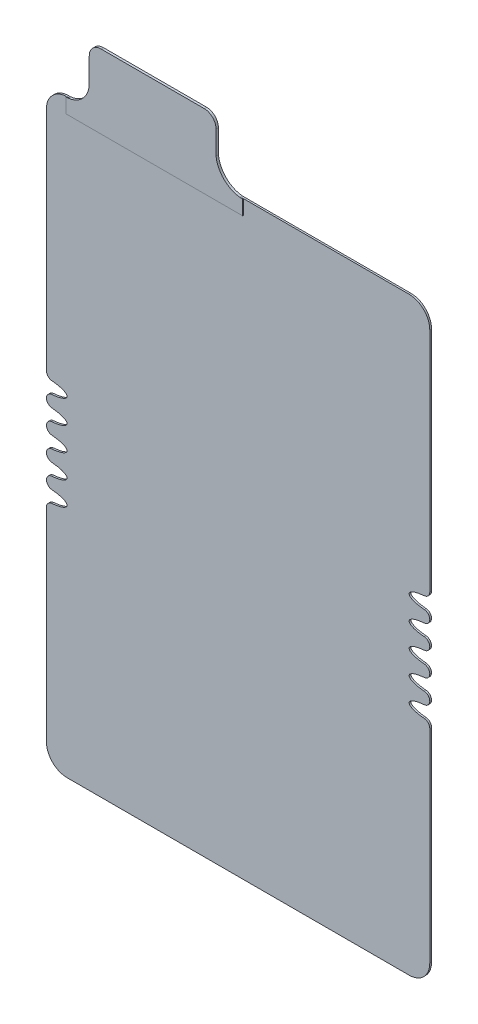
ISO-10303-21;
HEADER;
FILE_DESCRIPTION(('STEP AP214'),'2;1');
FILE_NAME('part.step','',(''),(''),'','','');
FILE_SCHEMA(('AUTOMOTIVE_DESIGN { 1 0 10303 214 1 1 1 1 }'));
ENDSEC;
DATA;
#1=APPLICATION_CONTEXT('core data for automotive mechanical design processes');
#2=APPLICATION_PROTOCOL_DEFINITION('international standard','automotive_design',2000,#1);
#3=PRODUCT_CONTEXT('',#1,'mechanical');
#4=PRODUCT('Part','Part','',(#3));
#5=PRODUCT_RELATED_PRODUCT_CATEGORY('part','',(#4));
#6=PRODUCT_DEFINITION_FORMATION('','',#4);
#7=PRODUCT_DEFINITION_CONTEXT('part definition',#1,'design');
#8=PRODUCT_DEFINITION('design','',#6,#7);
#9=PRODUCT_DEFINITION_SHAPE('','',#8);
#10=(LENGTH_UNIT() NAMED_UNIT(*) SI_UNIT(.MILLI.,.METRE.));
#11=(NAMED_UNIT(*) PLANE_ANGLE_UNIT() SI_UNIT($,.RADIAN.));
#12=(NAMED_UNIT(*) SI_UNIT($,.STERADIAN.) SOLID_ANGLE_UNIT());
#13=UNCERTAINTY_MEASURE_WITH_UNIT(LENGTH_MEASURE(1.E-05),#10,'distance_accuracy_value','');
#14=(GEOMETRIC_REPRESENTATION_CONTEXT(3) GLOBAL_UNCERTAINTY_ASSIGNED_CONTEXT((#13)) GLOBAL_UNIT_ASSIGNED_CONTEXT((#10,
#11,#12)) REPRESENTATION_CONTEXT('',''));
#15=CARTESIAN_POINT('',(0.,0.,0.));
#16=DIRECTION('',(0.,0.,1.));
#17=DIRECTION('',(1.,0.,0.));
#18=AXIS2_PLACEMENT_3D('',#15,#16,#17);
#19=CARTESIAN_POINT('',(-63.,4.01464371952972,0.6));
#20=DIRECTION('',(0.,0.,-1.));
#21=DIRECTION('',(-1.,0.,0.));
#22=AXIS2_PLACEMENT_3D('',#19,#20,#21);
#23=CYLINDRICAL_SURFACE('',#22,2.);
#24=CARTESIAN_POINT('',(-63.,4.01464371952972,0.));
#25=DIRECTION('',(0.,0.,1.));
#26=DIRECTION('',(1.,0.,0.));
#27=AXIS2_PLACEMENT_3D('',#24,#25,#26);
#28=CIRCLE('',#27,2.);
#29=CARTESIAN_POINT('',(-63.1622955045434,2.02123955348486,0.));
#30=VERTEX_POINT('',#29);
#31=CARTESIAN_POINT('',(-64.999946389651,3.99999999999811,0.));
#32=VERTEX_POINT('',#31);
#33=EDGE_CURVE('E599',#30,#32,#28,.F.);
#34=ORIENTED_EDGE('',*,*,#33,.F.);
#35=DIRECTION('',(0.,0.,-1.));
#36=VECTOR('',#35,1.);
#37=CARTESIAN_POINT('',(-63.1622955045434,2.02123955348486,0.6));
#38=LINE('',#37,#36);
#39=CARTESIAN_POINT('',(-63.1622955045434,2.02123955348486,0.6));
#40=VERTEX_POINT('',#39);
#41=EDGE_CURVE('E11',#40,#30,#38,.T.);
#42=ORIENTED_EDGE('',*,*,#41,.F.);
#43=CARTESIAN_POINT('',(-63.,4.01464371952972,0.6));
#44=DIRECTION('',(0.,0.,1.));
#45=DIRECTION('',(1.,0.,0.));
#46=AXIS2_PLACEMENT_3D('',#43,#44,#45);
#47=CIRCLE('',#46,2.);
#48=CARTESIAN_POINT('',(-64.999946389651,3.99999999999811,0.6));
#49=VERTEX_POINT('',#48);
#50=EDGE_CURVE('E726',#40,#49,#47,.F.);
#51=ORIENTED_EDGE('',*,*,#50,.T.);
#52=DIRECTION('',(0.,0.,-1.));
#53=VECTOR('',#52,1.);
#54=CARTESIAN_POINT('',(-64.999946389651,3.99999999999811,0.6));
#55=LINE('',#54,#53);
#56=EDGE_CURVE('E189',#49,#32,#55,.T.);
#57=ORIENTED_EDGE('',*,*,#56,.T.);
#58=EDGE_LOOP('',(#34,#42,#51,#57));
#59=FACE_BOUND('',#58,.T.);
#60=ADVANCED_FACE('F41',(#59),#23,.T.);
#61=CARTESIAN_POINT('',(-64.9999999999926,-3.85912223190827E-13,0.6));
#62=DIRECTION('',(0.,0.,-1.));
#63=DIRECTION('',(1.,0.,0.));
#64=AXIS2_PLACEMENT_3D('',#61,#62,#63);
#65=ELLIPSE('',#64,6.99996850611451,2.09471433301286);
#66=DIRECTION('',(0.,0.,-1.));
#67=VECTOR('',#66,1.);
#68=SURFACE_OF_LINEAR_EXTRUSION('',#65,#67);
#69=CARTESIAN_POINT('',(-64.9999999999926,-3.85912223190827E-13,0.));
#70=DIRECTION('',(0.,0.,-1.));
#71=DIRECTION('',(1.,0.,0.));
#72=AXIS2_PLACEMENT_3D('',#69,#70,#71);
#73=ELLIPSE('',#72,6.99996850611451,2.09471433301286);
#74=CARTESIAN_POINT('',(-63.1622955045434,-2.02123955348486,0.));
#75=VERTEX_POINT('',#74);
#76=EDGE_CURVE('E589',#30,#75,#73,.T.);
#77=ORIENTED_EDGE('',*,*,#76,.T.);
#78=DIRECTION('',(0.,0.,-1.));
#79=VECTOR('',#78,1.);
#80=CARTESIAN_POINT('',(-63.1622955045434,-2.02123955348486,0.6));
#81=LINE('',#80,#79);
#82=CARTESIAN_POINT('',(-63.1622955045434,-2.02123955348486,0.6));
#83=VERTEX_POINT('',#82);
#84=EDGE_CURVE('E50',#83,#75,#81,.T.);
#85=ORIENTED_EDGE('',*,*,#84,.F.);
#86=EDGE_CURVE('E773',#40,#83,#65,.T.);
#87=ORIENTED_EDGE('',*,*,#86,.F.);
#88=ORIENTED_EDGE('',*,*,#41,.T.);
#89=EDGE_LOOP('',(#77,#85,#87,#88));
#90=FACE_BOUND('',#89,.T.);
#91=ADVANCED_FACE('F865',(#90),#68,.F.);
#92=CARTESIAN_POINT('',(-63.,-4.01464371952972,0.6));
#93=DIRECTION('',(0.,0.,-1.));
#94=DIRECTION('',(-1.,0.,0.));
#95=AXIS2_PLACEMENT_3D('',#92,#93,#94);
#96=CYLINDRICAL_SURFACE('',#95,2.);
#97=CARTESIAN_POINT('',(-63.,-4.01464371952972,0.));
#98=DIRECTION('',(0.,0.,1.));
#99=DIRECTION('',(1.,0.,0.));
#100=AXIS2_PLACEMENT_3D('',#97,#98,#99);
#101=CIRCLE('',#100,2.);
#102=CARTESIAN_POINT('',(-64.9999463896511,-4.00000000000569,0.));
#103=VERTEX_POINT('',#102);
#104=EDGE_CURVE('E580',#75,#103,#101,.T.);
#105=ORIENTED_EDGE('',*,*,#104,.T.);
#106=DIRECTION('',(0.,0.,-1.));
#107=VECTOR('',#106,1.);
#108=CARTESIAN_POINT('',(-64.9999463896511,-4.00000000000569,0.6));
#109=LINE('',#108,#107);
#110=CARTESIAN_POINT('',(-64.9999463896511,-4.00000000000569,0.6));
#111=VERTEX_POINT('',#110);
#112=EDGE_CURVE('E569',#111,#103,#109,.T.);
#113=ORIENTED_EDGE('',*,*,#112,.F.);
#114=CARTESIAN_POINT('',(-63.,-4.01464371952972,0.6));
#115=DIRECTION('',(0.,0.,1.));
#116=DIRECTION('',(1.,0.,0.));
#117=AXIS2_PLACEMENT_3D('',#114,#115,#116);
#118=CIRCLE('',#117,2.);
#119=EDGE_CURVE('E582',#83,#111,#118,.T.);
#120=ORIENTED_EDGE('',*,*,#119,.F.);
#121=ORIENTED_EDGE('',*,*,#84,.T.);
#122=EDGE_LOOP('',(#105,#113,#120,#121));
#123=FACE_BOUND('',#122,.T.);
#124=ADVANCED_FACE('F578',(#123),#96,.T.);
#125=CARTESIAN_POINT('',(-63.0000000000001,-3.98535628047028,0.6));
#126=DIRECTION('',(0.,0.,-1.));
#127=DIRECTION('',(-1.,0.,0.));
#128=AXIS2_PLACEMENT_3D('',#125,#126,#127);
#129=CYLINDRICAL_SURFACE('',#128,2.);
#130=CARTESIAN_POINT('',(-63.0000000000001,-3.98535628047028,0.));
#131=DIRECTION('',(0.,0.,1.));
#132=DIRECTION('',(1.,0.,0.));
#133=AXIS2_PLACEMENT_3D('',#130,#131,#132);
#134=CIRCLE('',#133,2.);
#135=CARTESIAN_POINT('',(-63.1622955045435,-5.97876044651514,0.));
#136=VERTEX_POINT('',#135);
#137=EDGE_CURVE('E592',#136,#103,#134,.F.);
#138=ORIENTED_EDGE('',*,*,#137,.F.);
#139=DIRECTION('',(0.,0.,-1.));
#140=VECTOR('',#139,1.);
#141=CARTESIAN_POINT('',(-63.1622955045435,-5.97876044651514,0.6));
#142=LINE('',#141,#140);
#143=CARTESIAN_POINT('',(-63.1622955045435,-5.97876044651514,0.6));
#144=VERTEX_POINT('',#143);
#145=EDGE_CURVE('E566',#144,#136,#142,.T.);
#146=ORIENTED_EDGE('',*,*,#145,.F.);
#147=CARTESIAN_POINT('',(-63.0000000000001,-3.98535628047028,0.6));
#148=DIRECTION('',(0.,0.,1.));
#149=DIRECTION('',(1.,0.,0.));
#150=AXIS2_PLACEMENT_3D('',#147,#148,#149);
#151=CIRCLE('',#150,2.);
#152=EDGE_CURVE('E778',#144,#111,#151,.F.);
#153=ORIENTED_EDGE('',*,*,#152,.T.);
#154=ORIENTED_EDGE('',*,*,#112,.T.);
#155=EDGE_LOOP('',(#138,#146,#153,#154));
#156=FACE_BOUND('',#155,.T.);
#157=ADVANCED_FACE('F891',(#156),#129,.T.);
#158=CARTESIAN_POINT('',(-64.9999999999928,-8.00000000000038,0.6));
#159=DIRECTION('',(0.,0.,-1.));
#160=DIRECTION('',(1.,0.,0.));
#161=AXIS2_PLACEMENT_3D('',#158,#159,#160);
#162=ELLIPSE('',#161,6.99997711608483,2.09471414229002);
#163=DIRECTION('',(0.,0.,-1.));
#164=VECTOR('',#163,1.);
#165=SURFACE_OF_LINEAR_EXTRUSION('',#162,#164);
#166=CARTESIAN_POINT('',(-64.9999999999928,-8.00000000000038,0.));
#167=DIRECTION('',(0.,0.,-1.));
#168=DIRECTION('',(1.,0.,0.));
#169=AXIS2_PLACEMENT_3D('',#166,#167,#168);
#170=ELLIPSE('',#169,6.99997711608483,2.09471414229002);
#171=CARTESIAN_POINT('',(-63.1622955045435,-10.0212395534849,0.));
#172=VERTEX_POINT('',#171);
#173=EDGE_CURVE('E597',#136,#172,#170,.T.);
#174=ORIENTED_EDGE('',*,*,#173,.T.);
#175=DIRECTION('',(0.,0.,-1.));
#176=VECTOR('',#175,1.);
#177=CARTESIAN_POINT('',(-63.1622955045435,-10.0212395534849,0.6));
#178=LINE('',#177,#176);
#179=CARTESIAN_POINT('',(-63.1622955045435,-10.0212395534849,0.6));
#180=VERTEX_POINT('',#179);
#181=EDGE_CURVE('E562',#180,#172,#178,.T.);
#182=ORIENTED_EDGE('',*,*,#181,.F.);
#183=EDGE_CURVE('E782',#144,#180,#162,.T.);
#184=ORIENTED_EDGE('',*,*,#183,.F.);
#185=ORIENTED_EDGE('',*,*,#145,.T.);
#186=EDGE_LOOP('',(#174,#182,#184,#185));
#187=FACE_BOUND('',#186,.T.);
#188=ADVANCED_FACE('F894',(#187),#165,.F.);
#189=CARTESIAN_POINT('',(-63.0000000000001,-12.0146437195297,0.6));
#190=DIRECTION('',(0.,0.,-1.));
#191=DIRECTION('',(-1.,0.,0.));
#192=AXIS2_PLACEMENT_3D('',#189,#190,#191);
#193=CYLINDRICAL_SURFACE('',#192,2.);
#194=CARTESIAN_POINT('',(-63.0000000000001,-12.0146437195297,0.));
#195=DIRECTION('',(0.,0.,1.));
#196=DIRECTION('',(1.,0.,0.));
#197=AXIS2_PLACEMENT_3D('',#194,#195,#196);
#198=CIRCLE('',#197,2.);
#199=CARTESIAN_POINT('',(-64.9999463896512,-12.0000000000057,0.));
#200=VERTEX_POINT('',#199);
#201=EDGE_CURVE('E604',#172,#200,#198,.T.);
#202=ORIENTED_EDGE('',*,*,#201,.T.);
#203=DIRECTION('',(0.,0.,-1.));
#204=VECTOR('',#203,1.);
#205=CARTESIAN_POINT('',(-64.9999463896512,-12.0000000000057,0.6));
#206=LINE('',#205,#204);
#207=CARTESIAN_POINT('',(-64.9999463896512,-12.0000000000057,0.6));
#208=VERTEX_POINT('',#207);
#209=EDGE_CURVE('E559',#208,#200,#206,.T.);
#210=ORIENTED_EDGE('',*,*,#209,.F.);
#211=CARTESIAN_POINT('',(-63.0000000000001,-12.0146437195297,0.6));
#212=DIRECTION('',(0.,0.,1.));
#213=DIRECTION('',(1.,0.,0.));
#214=AXIS2_PLACEMENT_3D('',#211,#212,#213);
#215=CIRCLE('',#214,2.);
#216=EDGE_CURVE('E785',#180,#208,#215,.T.);
#217=ORIENTED_EDGE('',*,*,#216,.F.);
#218=ORIENTED_EDGE('',*,*,#181,.T.);
#219=EDGE_LOOP('',(#202,#210,#217,#218));
#220=FACE_BOUND('',#219,.T.);
#221=ADVANCED_FACE('F898',(#220),#193,.T.);
#222=CARTESIAN_POINT('',(-63.0000000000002,-11.9853562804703,0.6));
#223=DIRECTION('',(0.,0.,-1.));
#224=DIRECTION('',(-1.,0.,0.));
#225=AXIS2_PLACEMENT_3D('',#222,#223,#224);
#226=CYLINDRICAL_SURFACE('',#225,2.);
#227=CARTESIAN_POINT('',(-63.0000000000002,-11.9853562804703,0.));
#228=DIRECTION('',(0.,0.,1.));
#229=DIRECTION('',(1.,0.,0.));
#230=AXIS2_PLACEMENT_3D('',#227,#228,#229);
#231=CIRCLE('',#230,2.);
#232=CARTESIAN_POINT('',(-63.1622955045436,-13.9787604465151,0.));
#233=VERTEX_POINT('',#232);
#234=EDGE_CURVE('E608',#233,#200,#231,.F.);
#235=ORIENTED_EDGE('',*,*,#234,.F.);
#236=DIRECTION('',(0.,0.,-1.));
#237=VECTOR('',#236,1.);
#238=CARTESIAN_POINT('',(-63.1622955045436,-13.9787604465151,0.6));
#239=LINE('',#238,#237);
#240=CARTESIAN_POINT('',(-63.1622955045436,-13.9787604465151,0.6));
#241=VERTEX_POINT('',#240);
#242=EDGE_CURVE('E556',#241,#233,#239,.T.);
#243=ORIENTED_EDGE('',*,*,#242,.F.);
#244=CARTESIAN_POINT('',(-63.0000000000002,-11.9853562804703,0.6));
#245=DIRECTION('',(0.,0.,1.));
#246=DIRECTION('',(1.,0.,0.));
#247=AXIS2_PLACEMENT_3D('',#244,#245,#246);
#248=CIRCLE('',#247,2.);
#249=EDGE_CURVE('E788',#241,#208,#248,.F.);
#250=ORIENTED_EDGE('',*,*,#249,.T.);
#251=ORIENTED_EDGE('',*,*,#209,.T.);
#252=EDGE_LOOP('',(#235,#243,#250,#251));
#253=FACE_BOUND('',#252,.T.);
#254=ADVANCED_FACE('F908',(#253),#226,.T.);
#255=CARTESIAN_POINT('',(-64.9999999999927,-16.0000000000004,0.6));
#256=DIRECTION('',(0.,0.,-1.));
#257=DIRECTION('',(1.,0.,0.));
#258=AXIS2_PLACEMENT_3D('',#255,#256,#257);
#259=ELLIPSE('',#258,6.99996746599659,2.09471435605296);
#260=DIRECTION('',(0.,0.,-1.));
#261=VECTOR('',#260,1.);
#262=SURFACE_OF_LINEAR_EXTRUSION('',#259,#261);
#263=CARTESIAN_POINT('',(-64.9999999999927,-16.0000000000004,0.));
#264=DIRECTION('',(0.,0.,-1.));
#265=DIRECTION('',(1.,0.,0.));
#266=AXIS2_PLACEMENT_3D('',#263,#264,#265);
#267=ELLIPSE('',#266,6.99996746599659,2.09471435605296);
#268=CARTESIAN_POINT('',(-63.1622955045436,-18.0212395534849,0.));
#269=VERTEX_POINT('',#268);
#270=EDGE_CURVE('E612',#233,#269,#267,.T.);
#271=ORIENTED_EDGE('',*,*,#270,.T.);
#272=DIRECTION('',(0.,0.,-1.));
#273=VECTOR('',#272,1.);
#274=CARTESIAN_POINT('',(-63.1622955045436,-18.0212395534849,0.6));
#275=LINE('',#274,#273);
#276=CARTESIAN_POINT('',(-63.1622955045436,-18.0212395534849,0.6));
#277=VERTEX_POINT('',#276);
#278=EDGE_CURVE('E552',#277,#269,#275,.T.);
#279=ORIENTED_EDGE('',*,*,#278,.F.);
#280=EDGE_CURVE('E792',#241,#277,#259,.T.);
#281=ORIENTED_EDGE('',*,*,#280,.F.);
#282=ORIENTED_EDGE('',*,*,#242,.T.);
#283=EDGE_LOOP('',(#271,#279,#281,#282));
#284=FACE_BOUND('',#283,.T.);
#285=ADVANCED_FACE('F904',(#284),#262,.F.);
#286=CARTESIAN_POINT('',(-63.0000000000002,-20.0146437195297,0.6));
#287=DIRECTION('',(0.,0.,-1.));
#288=DIRECTION('',(-1.,0.,0.));
#289=AXIS2_PLACEMENT_3D('',#286,#287,#288);
#290=CYLINDRICAL_SURFACE('',#289,2.);
#291=CARTESIAN_POINT('',(-63.0000000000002,-20.0146437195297,0.));
#292=DIRECTION('',(0.,0.,1.));
#293=DIRECTION('',(1.,0.,0.));
#294=AXIS2_PLACEMENT_3D('',#291,#292,#293);
#295=CIRCLE('',#294,2.);
#296=CARTESIAN_POINT('',(-65.0000000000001,-20.0146437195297,0.));
#297=VERTEX_POINT('',#296);
#298=EDGE_CURVE('E615',#269,#297,#295,.T.);
#299=ORIENTED_EDGE('',*,*,#298,.T.);
#300=DIRECTION('',(0.,0.,-1.));
#301=VECTOR('',#300,1.);
#302=CARTESIAN_POINT('',(-65.0000000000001,-20.0146437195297,0.6));
#303=LINE('',#302,#301);
#304=CARTESIAN_POINT('',(-65.0000000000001,-20.0146437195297,0.6));
#305=VERTEX_POINT('',#304);
#306=EDGE_CURVE('E548',#305,#297,#303,.T.);
#307=ORIENTED_EDGE('',*,*,#306,.F.);
#308=CARTESIAN_POINT('',(-63.0000000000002,-20.0146437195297,0.6));
#309=DIRECTION('',(0.,0.,1.));
#310=DIRECTION('',(1.,0.,0.));
#311=AXIS2_PLACEMENT_3D('',#308,#309,#310);
#312=CIRCLE('',#311,2.);
#313=EDGE_CURVE('E795',#277,#305,#312,.T.);
#314=ORIENTED_EDGE('',*,*,#313,.F.);
#315=ORIENTED_EDGE('',*,*,#278,.T.);
#316=EDGE_LOOP('',(#299,#307,#314,#315));
#317=FACE_BOUND('',#316,.T.);
#318=ADVANCED_FACE('F907',(#317),#290,.T.);
#319=CARTESIAN_POINT('',(-65.0000000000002,-1.63979034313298E-13,0.6));
#320=DIRECTION('',(1.,0.,0.));
#321=DIRECTION('',(0.,1.,0.));
#322=AXIS2_PLACEMENT_3D('',#319,#320,#321);
#323=PLANE('',#322);
#324=DIRECTION('',(0.,-1.,0.));
#325=VECTOR('',#324,1.);
#326=CARTESIAN_POINT('',(-65.0000000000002,-1.63979034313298E-13,0.));
#327=LINE('',#326,#325);
#328=CARTESIAN_POINT('',(-65.,-89.,0.));
#329=VERTEX_POINT('',#328);
#330=EDGE_CURVE('E618',#297,#329,#327,.T.);
#331=ORIENTED_EDGE('',*,*,#330,.T.);
#332=DIRECTION('',(0.,0.,-1.));
#333=VECTOR('',#332,1.);
#334=CARTESIAN_POINT('',(-65.,-89.,0.6));
#335=LINE('',#334,#333);
#336=CARTESIAN_POINT('',(-65.,-89.,0.6));
#337=VERTEX_POINT('',#336);
#338=EDGE_CURVE('E544',#337,#329,#335,.T.);
#339=ORIENTED_EDGE('',*,*,#338,.F.);
#340=DIRECTION('',(0.,-1.,0.));
#341=VECTOR('',#340,1.);
#342=CARTESIAN_POINT('',(-65.0000000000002,-1.63979034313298E-13,0.6));
#343=LINE('',#342,#341);
#344=EDGE_CURVE('E798',#305,#337,#343,.T.);
#345=ORIENTED_EDGE('',*,*,#344,.F.);
#346=ORIENTED_EDGE('',*,*,#306,.T.);
#347=EDGE_LOOP('',(#331,#339,#345,#346));
#348=FACE_BOUND('',#347,.T.);
#349=ADVANCED_FACE('F938',(#348),#323,.F.);
#350=CARTESIAN_POINT('',(-58.,-89.,0.6));
#351=DIRECTION('',(0.,0.,-1.));
#352=DIRECTION('',(-1.,0.,0.));
#353=AXIS2_PLACEMENT_3D('',#350,#351,#352);
#354=CYLINDRICAL_SURFACE('',#353,7.00000000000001);
#355=CARTESIAN_POINT('',(-58.,-89.,0.));
#356=DIRECTION('',(0.,0.,1.));
#357=DIRECTION('',(1.,0.,0.));
#358=AXIS2_PLACEMENT_3D('',#355,#356,#357);
#359=CIRCLE('',#358,7.00000000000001);
#360=CARTESIAN_POINT('',(-58.,-96.,0.));
#361=VERTEX_POINT('',#360);
#362=EDGE_CURVE('E621',#329,#361,#359,.T.);
#363=ORIENTED_EDGE('',*,*,#362,.T.);
#364=DIRECTION('',(0.,0.,-1.));
#365=VECTOR('',#364,1.);
#366=CARTESIAN_POINT('',(-58.,-96.,0.6));
#367=LINE('',#366,#365);
#368=CARTESIAN_POINT('',(-58.,-96.,0.6));
#369=VERTEX_POINT('',#368);
#370=EDGE_CURVE('E540',#369,#361,#367,.T.);
#371=ORIENTED_EDGE('',*,*,#370,.F.);
#372=CARTESIAN_POINT('',(-58.,-89.,0.6));
#373=DIRECTION('',(0.,0.,1.));
#374=DIRECTION('',(1.,0.,0.));
#375=AXIS2_PLACEMENT_3D('',#372,#373,#374);
#376=CIRCLE('',#375,7.00000000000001);
#377=EDGE_CURVE('E801',#337,#369,#376,.T.);
#378=ORIENTED_EDGE('',*,*,#377,.F.);
#379=ORIENTED_EDGE('',*,*,#338,.T.);
#380=EDGE_LOOP('',(#363,#371,#378,#379));
#381=FACE_BOUND('',#380,.T.);
#382=ADVANCED_FACE('F941',(#381),#354,.T.);
#383=CARTESIAN_POINT('',(0.,-96.,0.6));
#384=DIRECTION('',(0.,1.,0.));
#385=DIRECTION('',(-1.,0.,0.));
#386=AXIS2_PLACEMENT_3D('',#383,#384,#385);
#387=PLANE('',#386);
#388=DIRECTION('',(1.,0.,0.));
#389=VECTOR('',#388,1.);
#390=CARTESIAN_POINT('',(0.,-96.,0.));
#391=LINE('',#390,#389);
#392=CARTESIAN_POINT('',(58.,-96.,0.));
#393=VERTEX_POINT('',#392);
#394=EDGE_CURVE('E624',#361,#393,#391,.T.);
#395=ORIENTED_EDGE('',*,*,#394,.T.);
#396=DIRECTION('',(0.,0.,-1.));
#397=VECTOR('',#396,1.);
#398=CARTESIAN_POINT('',(58.,-96.,0.6));
#399=LINE('',#398,#397);
#400=CARTESIAN_POINT('',(58.,-96.,0.6));
#401=VERTEX_POINT('',#400);
#402=EDGE_CURVE('E536',#401,#393,#399,.T.);
#403=ORIENTED_EDGE('',*,*,#402,.F.);
#404=DIRECTION('',(1.,0.,0.));
#405=VECTOR('',#404,1.);
#406=CARTESIAN_POINT('',(0.,-96.,0.6));
#407=LINE('',#406,#405);
#408=EDGE_CURVE('E804',#369,#401,#407,.T.);
#409=ORIENTED_EDGE('',*,*,#408,.F.);
#410=ORIENTED_EDGE('',*,*,#370,.T.);
#411=EDGE_LOOP('',(#395,#403,#409,#410));
#412=FACE_BOUND('',#411,.T.);
#413=ADVANCED_FACE('F946',(#412),#387,.F.);
#414=CARTESIAN_POINT('',(58.,-89.,0.6));
#415=DIRECTION('',(0.,0.,-1.));
#416=DIRECTION('',(-1.,0.,0.));
#417=AXIS2_PLACEMENT_3D('',#414,#415,#416);
#418=CYLINDRICAL_SURFACE('',#417,7.);
#419=CARTESIAN_POINT('',(58.,-89.,0.));
#420=DIRECTION('',(0.,0.,1.));
#421=DIRECTION('',(1.,0.,0.));
#422=AXIS2_PLACEMENT_3D('',#419,#420,#421);
#423=CIRCLE('',#422,7.);
#424=CARTESIAN_POINT('',(65.,-89.,0.));
#425=VERTEX_POINT('',#424);
#426=EDGE_CURVE('E627',#393,#425,#423,.T.);
#427=ORIENTED_EDGE('',*,*,#426,.T.);
#428=DIRECTION('',(0.,0.,-1.));
#429=VECTOR('',#428,1.);
#430=CARTESIAN_POINT('',(65.,-89.,0.6));
#431=LINE('',#430,#429);
#432=CARTESIAN_POINT('',(65.,-89.,0.6));
#433=VERTEX_POINT('',#432);
#434=EDGE_CURVE('E533',#433,#425,#431,.T.);
#435=ORIENTED_EDGE('',*,*,#434,.F.);
#436=CARTESIAN_POINT('',(58.,-89.,0.6));
#437=DIRECTION('',(0.,0.,1.));
#438=DIRECTION('',(1.,0.,0.));
#439=AXIS2_PLACEMENT_3D('',#436,#437,#438);
#440=CIRCLE('',#439,7.);
#441=EDGE_CURVE('E807',#401,#433,#440,.T.);
#442=ORIENTED_EDGE('',*,*,#441,.F.);
#443=ORIENTED_EDGE('',*,*,#402,.T.);
#444=EDGE_LOOP('',(#427,#435,#442,#443));
#445=FACE_BOUND('',#444,.T.);
#446=ADVANCED_FACE('F952',(#445),#418,.T.);
#447=CARTESIAN_POINT('',(65.0000000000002,-1.5691264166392E-13,0.6));
#448=DIRECTION('',(1.,0.,0.));
#449=DIRECTION('',(0.,1.,0.));
#450=AXIS2_PLACEMENT_3D('',#447,#448,#449);
#451=PLANE('',#450);
#452=DIRECTION('',(0.,-1.,0.));
#453=VECTOR('',#452,1.);
#454=CARTESIAN_POINT('',(65.0000000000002,-1.5691264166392E-13,0.));
#455=LINE('',#454,#453);
#456=CARTESIAN_POINT('',(65.0000000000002,-20.0146437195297,0.));
#457=VERTEX_POINT('',#456);
#458=EDGE_CURVE('E631',#457,#425,#455,.T.);
#459=ORIENTED_EDGE('',*,*,#458,.F.);
#460=DIRECTION('',(0.,0.,-1.));
#461=VECTOR('',#460,1.);
#462=CARTESIAN_POINT('',(65.0000000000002,-20.0146437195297,0.6));
#463=LINE('',#462,#461);
#464=CARTESIAN_POINT('',(65.0000000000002,-20.0146437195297,0.6));
#465=VERTEX_POINT('',#464);
#466=EDGE_CURVE('E530',#465,#457,#463,.T.);
#467=ORIENTED_EDGE('',*,*,#466,.F.);
#468=DIRECTION('',(0.,-1.,0.));
#469=VECTOR('',#468,1.);
#470=CARTESIAN_POINT('',(65.0000000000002,-1.5691264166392E-13,0.6));
#471=LINE('',#470,#469);
#472=EDGE_CURVE('E810',#465,#433,#471,.T.);
#473=ORIENTED_EDGE('',*,*,#472,.T.);
#474=ORIENTED_EDGE('',*,*,#434,.T.);
#475=EDGE_LOOP('',(#459,#467,#473,#474));
#476=FACE_BOUND('',#475,.T.);
#477=ADVANCED_FACE('F956',(#476),#451,.T.);
#478=CARTESIAN_POINT('',(63.0000000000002,-20.0146437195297,0.6));
#479=DIRECTION('',(0.,0.,-1.));
#480=DIRECTION('',(-1.,0.,0.));
#481=AXIS2_PLACEMENT_3D('',#478,#479,#480);
#482=CYLINDRICAL_SURFACE('',#481,2.);
#483=CARTESIAN_POINT('',(63.0000000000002,-20.0146437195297,0.));
#484=DIRECTION('',(0.,0.,1.));
#485=DIRECTION('',(1.,0.,0.));
#486=AXIS2_PLACEMENT_3D('',#483,#484,#485);
#487=CIRCLE('',#486,2.);
#488=CARTESIAN_POINT('',(63.1622955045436,-18.0212395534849,0.));
#489=VERTEX_POINT('',#488);
#490=EDGE_CURVE('E635',#489,#457,#487,.F.);
#491=ORIENTED_EDGE('',*,*,#490,.F.);
#492=DIRECTION('',(0.,0.,-1.));
#493=VECTOR('',#492,1.);
#494=CARTESIAN_POINT('',(63.1622955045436,-18.0212395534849,0.6));
#495=LINE('',#494,#493);
#496=CARTESIAN_POINT('',(63.1622955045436,-18.0212395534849,0.6));
#497=VERTEX_POINT('',#496);
#498=EDGE_CURVE('E527',#497,#489,#495,.T.);
#499=ORIENTED_EDGE('',*,*,#498,.F.);
#500=CARTESIAN_POINT('',(63.0000000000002,-20.0146437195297,0.6));
#501=DIRECTION('',(0.,0.,1.));
#502=DIRECTION('',(1.,0.,0.));
#503=AXIS2_PLACEMENT_3D('',#500,#501,#502);
#504=CIRCLE('',#503,2.);
#505=EDGE_CURVE('E814',#497,#465,#504,.F.);
#506=ORIENTED_EDGE('',*,*,#505,.T.);
#507=ORIENTED_EDGE('',*,*,#466,.T.);
#508=EDGE_LOOP('',(#491,#499,#506,#507));
#509=FACE_BOUND('',#508,.T.);
#510=ADVANCED_FACE('F959',(#509),#482,.T.);
#511=CARTESIAN_POINT('',(64.9999999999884,-16.0000000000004,0.6));
#512=DIRECTION('',(0.,0.,1.));
#513=DIRECTION('',(-1.,0.,0.));
#514=AXIS2_PLACEMENT_3D('',#511,#512,#513);
#515=ELLIPSE('',#514,6.99997657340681,2.09471415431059);
#516=DIRECTION('',(0.,0.,-1.));
#517=VECTOR('',#516,1.);
#518=SURFACE_OF_LINEAR_EXTRUSION('',#515,#517);
#519=CARTESIAN_POINT('',(64.9999999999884,-16.0000000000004,0.));
#520=DIRECTION('',(0.,0.,1.));
#521=DIRECTION('',(-1.,0.,0.));
#522=AXIS2_PLACEMENT_3D('',#519,#520,#521);
#523=ELLIPSE('',#522,6.99997657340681,2.09471415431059);
#524=CARTESIAN_POINT('',(63.1622955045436,-13.9787604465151,0.));
#525=VERTEX_POINT('',#524);
#526=EDGE_CURVE('E639',#525,#489,#523,.T.);
#527=ORIENTED_EDGE('',*,*,#526,.F.);
#528=DIRECTION('',(0.,0.,-1.));
#529=VECTOR('',#528,1.);
#530=CARTESIAN_POINT('',(63.1622955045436,-13.9787604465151,0.6));
#531=LINE('',#530,#529);
#532=CARTESIAN_POINT('',(63.1622955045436,-13.9787604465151,0.6));
#533=VERTEX_POINT('',#532);
#534=EDGE_CURVE('E524',#533,#525,#531,.T.);
#535=ORIENTED_EDGE('',*,*,#534,.F.);
#536=EDGE_CURVE('E818',#533,#497,#515,.T.);
#537=ORIENTED_EDGE('',*,*,#536,.T.);
#538=ORIENTED_EDGE('',*,*,#498,.T.);
#539=EDGE_LOOP('',(#527,#535,#537,#538));
#540=FACE_BOUND('',#539,.T.);
#541=ADVANCED_FACE('F963',(#540),#518,.T.);
#542=CARTESIAN_POINT('',(63.0000000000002,-11.9853562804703,0.6));
#543=DIRECTION('',(0.,0.,-1.));
#544=DIRECTION('',(-1.,0.,0.));
#545=AXIS2_PLACEMENT_3D('',#542,#543,#544);
#546=CYLINDRICAL_SURFACE('',#545,2.);
#547=CARTESIAN_POINT('',(63.0000000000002,-11.9853562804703,0.));
#548=DIRECTION('',(0.,0.,1.));
#549=DIRECTION('',(1.,0.,0.));
#550=AXIS2_PLACEMENT_3D('',#547,#548,#549);
#551=CIRCLE('',#550,2.);
#552=CARTESIAN_POINT('',(64.9999463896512,-12.0000000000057,0.));
#553=VERTEX_POINT('',#552);
#554=EDGE_CURVE('E643',#525,#553,#551,.T.);
#555=ORIENTED_EDGE('',*,*,#554,.T.);
#556=DIRECTION('',(0.,0.,-1.));
#557=VECTOR('',#556,1.);
#558=CARTESIAN_POINT('',(64.9999463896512,-12.0000000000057,0.6));
#559=LINE('',#558,#557);
#560=CARTESIAN_POINT('',(64.9999463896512,-12.0000000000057,0.6));
#561=VERTEX_POINT('',#560);
#562=EDGE_CURVE('E521',#561,#553,#559,.T.);
#563=ORIENTED_EDGE('',*,*,#562,.F.);
#564=CARTESIAN_POINT('',(63.0000000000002,-11.9853562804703,0.6));
#565=DIRECTION('',(0.,0.,1.));
#566=DIRECTION('',(1.,0.,0.));
#567=AXIS2_PLACEMENT_3D('',#564,#565,#566);
#568=CIRCLE('',#567,2.);
#569=EDGE_CURVE('E822',#533,#561,#568,.T.);
#570=ORIENTED_EDGE('',*,*,#569,.F.);
#571=ORIENTED_EDGE('',*,*,#534,.T.);
#572=EDGE_LOOP('',(#555,#563,#570,#571));
#573=FACE_BOUND('',#572,.T.);
#574=ADVANCED_FACE('F968',(#573),#546,.T.);
#575=CARTESIAN_POINT('',(63.0000000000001,-12.0146437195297,0.6));
#576=DIRECTION('',(0.,0.,-1.));
#577=DIRECTION('',(-1.,0.,0.));
#578=AXIS2_PLACEMENT_3D('',#575,#576,#577);
#579=CYLINDRICAL_SURFACE('',#578,2.);
#580=CARTESIAN_POINT('',(63.0000000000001,-12.0146437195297,0.));
#581=DIRECTION('',(0.,0.,1.));
#582=DIRECTION('',(1.,0.,0.));
#583=AXIS2_PLACEMENT_3D('',#580,#581,#582);
#584=CIRCLE('',#583,2.);
#585=CARTESIAN_POINT('',(63.1622955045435,-10.0212395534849,0.));
#586=VERTEX_POINT('',#585);
#587=EDGE_CURVE('E647',#586,#553,#584,.F.);
#588=ORIENTED_EDGE('',*,*,#587,.F.);
#589=DIRECTION('',(0.,0.,-1.));
#590=VECTOR('',#589,1.);
#591=CARTESIAN_POINT('',(63.1622955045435,-10.0212395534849,0.6));
#592=LINE('',#591,#590);
#593=CARTESIAN_POINT('',(63.1622955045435,-10.0212395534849,0.6));
#594=VERTEX_POINT('',#593);
#595=EDGE_CURVE('E518',#594,#586,#592,.T.);
#596=ORIENTED_EDGE('',*,*,#595,.F.);
#597=CARTESIAN_POINT('',(63.0000000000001,-12.0146437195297,0.6));
#598=DIRECTION('',(0.,0.,1.));
#599=DIRECTION('',(1.,0.,0.));
#600=AXIS2_PLACEMENT_3D('',#597,#598,#599);
#601=CIRCLE('',#600,2.);
#602=EDGE_CURVE('E825',#594,#561,#601,.F.);
#603=ORIENTED_EDGE('',*,*,#602,.T.);
#604=ORIENTED_EDGE('',*,*,#562,.T.);
#605=EDGE_LOOP('',(#588,#596,#603,#604));
#606=FACE_BOUND('',#605,.T.);
#607=ADVANCED_FACE('F1002',(#606),#579,.T.);
#608=CARTESIAN_POINT('',(64.9999999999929,-8.00000000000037,0.6));
#609=DIRECTION('',(0.,0.,1.));
#610=DIRECTION('',(-1.,0.,0.));
#611=AXIS2_PLACEMENT_3D('',#608,#609,#610);
#612=ELLIPSE('',#611,6.99997014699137,2.0947142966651);
#613=DIRECTION('',(0.,0.,-1.));
#614=VECTOR('',#613,1.);
#615=SURFACE_OF_LINEAR_EXTRUSION('',#612,#614);
#616=CARTESIAN_POINT('',(64.9999999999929,-8.00000000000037,0.));
#617=DIRECTION('',(0.,0.,1.));
#618=DIRECTION('',(-1.,0.,0.));
#619=AXIS2_PLACEMENT_3D('',#616,#617,#618);
#620=ELLIPSE('',#619,6.99997014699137,2.0947142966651);
#621=CARTESIAN_POINT('',(63.1622955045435,-5.97876044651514,0.));
#622=VERTEX_POINT('',#621);
#623=EDGE_CURVE('E651',#622,#586,#620,.T.);
#624=ORIENTED_EDGE('',*,*,#623,.F.);
#625=DIRECTION('',(0.,0.,-1.));
#626=VECTOR('',#625,1.);
#627=CARTESIAN_POINT('',(63.1622955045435,-5.97876044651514,0.6));
#628=LINE('',#627,#626);
#629=CARTESIAN_POINT('',(63.1622955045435,-5.97876044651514,0.6));
#630=VERTEX_POINT('',#629);
#631=EDGE_CURVE('E515',#630,#622,#628,.T.);
#632=ORIENTED_EDGE('',*,*,#631,.F.);
#633=EDGE_CURVE('E829',#630,#594,#612,.T.);
#634=ORIENTED_EDGE('',*,*,#633,.T.);
#635=ORIENTED_EDGE('',*,*,#595,.T.);
#636=EDGE_LOOP('',(#624,#632,#634,#635));
#637=FACE_BOUND('',#636,.T.);
#638=ADVANCED_FACE('F974',(#637),#615,.T.);
#639=CARTESIAN_POINT('',(63.0000000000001,-3.98535628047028,0.6));
#640=DIRECTION('',(0.,0.,-1.));
#641=DIRECTION('',(-1.,0.,0.));
#642=AXIS2_PLACEMENT_3D('',#639,#640,#641);
#643=CYLINDRICAL_SURFACE('',#642,2.);
#644=CARTESIAN_POINT('',(63.0000000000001,-3.98535628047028,0.));
#645=DIRECTION('',(0.,0.,1.));
#646=DIRECTION('',(1.,0.,0.));
#647=AXIS2_PLACEMENT_3D('',#644,#645,#646);
#648=CIRCLE('',#647,2.);
#649=CARTESIAN_POINT('',(64.9999463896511,-4.00000000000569,0.));
#650=VERTEX_POINT('',#649);
#651=EDGE_CURVE('E655',#622,#650,#648,.T.);
#652=ORIENTED_EDGE('',*,*,#651,.T.);
#653=DIRECTION('',(0.,0.,-1.));
#654=VECTOR('',#653,1.);
#655=CARTESIAN_POINT('',(64.9999463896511,-4.00000000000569,0.6));
#656=LINE('',#655,#654);
#657=CARTESIAN_POINT('',(64.9999463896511,-4.00000000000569,0.6));
#658=VERTEX_POINT('',#657);
#659=EDGE_CURVE('E512',#658,#650,#656,.T.);
#660=ORIENTED_EDGE('',*,*,#659,.F.);
#661=CARTESIAN_POINT('',(63.0000000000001,-3.98535628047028,0.6));
#662=DIRECTION('',(0.,0.,1.));
#663=DIRECTION('',(1.,0.,0.));
#664=AXIS2_PLACEMENT_3D('',#661,#662,#663);
#665=CIRCLE('',#664,2.);
#666=EDGE_CURVE('E833',#630,#658,#665,.T.);
#667=ORIENTED_EDGE('',*,*,#666,.F.);
#668=ORIENTED_EDGE('',*,*,#631,.T.);
#669=EDGE_LOOP('',(#652,#660,#667,#668));
#670=FACE_BOUND('',#669,.T.);
#671=ADVANCED_FACE('F980',(#670),#643,.T.);
#672=CARTESIAN_POINT('',(63.,-4.01464371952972,0.6));
#673=DIRECTION('',(0.,0.,-1.));
#674=DIRECTION('',(-1.,0.,0.));
#675=AXIS2_PLACEMENT_3D('',#672,#673,#674);
#676=CYLINDRICAL_SURFACE('',#675,2.);
#677=CARTESIAN_POINT('',(63.,-4.01464371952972,0.));
#678=DIRECTION('',(0.,0.,1.));
#679=DIRECTION('',(1.,0.,0.));
#680=AXIS2_PLACEMENT_3D('',#677,#678,#679);
#681=CIRCLE('',#680,2.);
#682=CARTESIAN_POINT('',(63.1622955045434,-2.02123955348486,0.));
#683=VERTEX_POINT('',#682);
#684=EDGE_CURVE('E659',#683,#650,#681,.F.);
#685=ORIENTED_EDGE('',*,*,#684,.F.);
#686=DIRECTION('',(0.,0.,-1.));
#687=VECTOR('',#686,1.);
#688=CARTESIAN_POINT('',(63.1622955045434,-2.02123955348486,0.6));
#689=LINE('',#688,#687);
#690=CARTESIAN_POINT('',(63.1622955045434,-2.02123955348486,0.6));
#691=VERTEX_POINT('',#690);
#692=EDGE_CURVE('E509',#691,#683,#689,.T.);
#693=ORIENTED_EDGE('',*,*,#692,.F.);
#694=CARTESIAN_POINT('',(63.,-4.01464371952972,0.6));
#695=DIRECTION('',(0.,0.,1.));
#696=DIRECTION('',(1.,0.,0.));
#697=AXIS2_PLACEMENT_3D('',#694,#695,#696);
#698=CIRCLE('',#697,2.);
#699=EDGE_CURVE('E836',#691,#658,#698,.F.);
#700=ORIENTED_EDGE('',*,*,#699,.T.);
#701=ORIENTED_EDGE('',*,*,#659,.T.);
#702=EDGE_LOOP('',(#685,#693,#700,#701));
#703=FACE_BOUND('',#702,.T.);
#704=ADVANCED_FACE('F990',(#703),#676,.T.);
#705=CARTESIAN_POINT('',(64.9999884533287,0.,0.6));
#706=DIRECTION('',(0.,0.,1.));
#707=DIRECTION('',(-1.,0.,0.));
#708=AXIS2_PLACEMENT_3D('',#705,#706,#707);
#709=ELLIPSE('',#708,6.9999764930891,2.09471318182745);
#710=DIRECTION('',(0.,0.,-1.));
#711=VECTOR('',#710,1.);
#712=SURFACE_OF_LINEAR_EXTRUSION('',#709,#711);
#713=CARTESIAN_POINT('',(64.9999884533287,0.,0.));
#714=DIRECTION('',(0.,0.,1.));
#715=DIRECTION('',(-1.,0.,0.));
#716=AXIS2_PLACEMENT_3D('',#713,#714,#715);
#717=ELLIPSE('',#716,6.9999764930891,2.09471318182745);
#718=CARTESIAN_POINT('',(63.1622955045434,2.02123955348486,0.));
#719=VERTEX_POINT('',#718);
#720=EDGE_CURVE('E663',#719,#683,#717,.T.);
#721=ORIENTED_EDGE('',*,*,#720,.F.);
#722=DIRECTION('',(0.,0.,-1.));
#723=VECTOR('',#722,1.);
#724=CARTESIAN_POINT('',(63.1622955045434,2.02123955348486,0.6));
#725=LINE('',#724,#723);
#726=CARTESIAN_POINT('',(63.1622955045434,2.02123955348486,0.6));
#727=VERTEX_POINT('',#726);
#728=EDGE_CURVE('E506',#727,#719,#725,.T.);
#729=ORIENTED_EDGE('',*,*,#728,.F.);
#730=EDGE_CURVE('E840',#727,#691,#709,.T.);
#731=ORIENTED_EDGE('',*,*,#730,.T.);
#732=ORIENTED_EDGE('',*,*,#692,.T.);
#733=EDGE_LOOP('',(#721,#729,#731,#732));
#734=FACE_BOUND('',#733,.T.);
#735=ADVANCED_FACE('F985',(#734),#712,.T.);
#736=CARTESIAN_POINT('',(63.,4.01464371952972,0.6));
#737=DIRECTION('',(0.,0.,-1.));
#738=DIRECTION('',(-1.,0.,0.));
#739=AXIS2_PLACEMENT_3D('',#736,#737,#738);
#740=CYLINDRICAL_SURFACE('',#739,2.);
#741=CARTESIAN_POINT('',(63.,4.01464371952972,0.));
#742=DIRECTION('',(0.,0.,1.));
#743=DIRECTION('',(1.,0.,0.));
#744=AXIS2_PLACEMENT_3D('',#741,#742,#743);
#745=CIRCLE('',#744,2.);
#746=CARTESIAN_POINT('',(64.999946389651,3.99999999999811,0.));
#747=VERTEX_POINT('',#746);
#748=EDGE_CURVE('E667',#719,#747,#745,.T.);
#749=ORIENTED_EDGE('',*,*,#748,.T.);
#750=DIRECTION('',(0.,0.,-1.));
#751=VECTOR('',#750,1.);
#752=CARTESIAN_POINT('',(64.999946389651,3.99999999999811,0.6));
#753=LINE('',#752,#751);
#754=CARTESIAN_POINT('',(64.999946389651,3.99999999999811,0.6));
#755=VERTEX_POINT('',#754);
#756=EDGE_CURVE('E503',#755,#747,#753,.T.);
#757=ORIENTED_EDGE('',*,*,#756,.F.);
#758=CARTESIAN_POINT('',(63.,4.01464371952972,0.6));
#759=DIRECTION('',(0.,0.,1.));
#760=DIRECTION('',(1.,0.,0.));
#761=AXIS2_PLACEMENT_3D('',#758,#759,#760);
#762=CIRCLE('',#761,2.);
#763=EDGE_CURVE('E844',#727,#755,#762,.T.);
#764=ORIENTED_EDGE('',*,*,#763,.F.);
#765=ORIENTED_EDGE('',*,*,#728,.T.);
#766=EDGE_LOOP('',(#749,#757,#764,#765));
#767=FACE_BOUND('',#766,.T.);
#768=ADVANCED_FACE('F989',(#767),#740,.T.);
#769=CARTESIAN_POINT('',(63.,3.98535628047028,0.6));
#770=DIRECTION('',(0.,0.,-1.));
#771=DIRECTION('',(-1.,0.,0.));
#772=AXIS2_PLACEMENT_3D('',#769,#770,#771);
#773=CYLINDRICAL_SURFACE('',#772,2.);
#774=CARTESIAN_POINT('',(63.,3.98535628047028,0.));
#775=DIRECTION('',(0.,0.,1.));
#776=DIRECTION('',(1.,0.,0.));
#777=AXIS2_PLACEMENT_3D('',#774,#775,#776);
#778=CIRCLE('',#777,2.);
#779=CARTESIAN_POINT('',(63.1622955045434,5.97876044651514,0.));
#780=VERTEX_POINT('',#779);
#781=EDGE_CURVE('E671',#780,#747,#778,.F.);
#782=ORIENTED_EDGE('',*,*,#781,.F.);
#783=DIRECTION('',(0.,0.,-1.));
#784=VECTOR('',#783,1.);
#785=CARTESIAN_POINT('',(63.1622955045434,5.97876044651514,0.6));
#786=LINE('',#785,#784);
#787=CARTESIAN_POINT('',(63.1622955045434,5.97876044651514,0.6));
#788=VERTEX_POINT('',#787);
#789=EDGE_CURVE('E500',#788,#780,#786,.T.);
#790=ORIENTED_EDGE('',*,*,#789,.F.);
#791=CARTESIAN_POINT('',(63.,3.98535628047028,0.6));
#792=DIRECTION('',(0.,0.,1.));
#793=DIRECTION('',(1.,0.,0.));
#794=AXIS2_PLACEMENT_3D('',#791,#792,#793);
#795=CIRCLE('',#794,2.);
#796=EDGE_CURVE('E439',#788,#755,#795,.F.);
#797=ORIENTED_EDGE('',*,*,#796,.T.);
#798=ORIENTED_EDGE('',*,*,#756,.T.);
#799=EDGE_LOOP('',(#782,#790,#797,#798));
#800=FACE_BOUND('',#799,.T.);
#801=ADVANCED_FACE('F430',(#800),#773,.T.);
#802=CARTESIAN_POINT('',(64.9999999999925,7.99999999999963,0.6));
#803=DIRECTION('',(0.,0.,1.));
#804=DIRECTION('',(-1.,0.,0.));
#805=AXIS2_PLACEMENT_3D('',#802,#803,#804);
#806=ELLIPSE('',#805,6.99996338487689,2.09471444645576);
#807=DIRECTION('',(0.,0.,-1.));
#808=VECTOR('',#807,1.);
#809=SURFACE_OF_LINEAR_EXTRUSION('',#806,#808);
#810=CARTESIAN_POINT('',(64.9999999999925,7.99999999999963,0.));
#811=DIRECTION('',(0.,0.,1.));
#812=DIRECTION('',(-1.,0.,0.));
#813=AXIS2_PLACEMENT_3D('',#810,#811,#812);
#814=ELLIPSE('',#813,6.99996338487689,2.09471444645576);
#815=CARTESIAN_POINT('',(63.1622955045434,10.0212395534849,0.));
#816=VERTEX_POINT('',#815);
#817=EDGE_CURVE('E675',#816,#780,#814,.T.);
#818=ORIENTED_EDGE('',*,*,#817,.F.);
#819=DIRECTION('',(0.,0.,-1.));
#820=VECTOR('',#819,1.);
#821=CARTESIAN_POINT('',(63.1622955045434,10.0212395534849,0.6));
#822=LINE('',#821,#820);
#823=CARTESIAN_POINT('',(63.1622955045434,10.0212395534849,0.6));
#824=VERTEX_POINT('',#823);
#825=EDGE_CURVE('E497',#824,#816,#822,.T.);
#826=ORIENTED_EDGE('',*,*,#825,.F.);
#827=EDGE_CURVE('E433',#824,#788,#806,.T.);
#828=ORIENTED_EDGE('',*,*,#827,.T.);
#829=ORIENTED_EDGE('',*,*,#789,.T.);
#830=EDGE_LOOP('',(#818,#826,#828,#829));
#831=FACE_BOUND('',#830,.T.);
#832=ADVANCED_FACE('F425',(#831),#809,.T.);
#833=CARTESIAN_POINT('',(63.,12.0146437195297,0.6));
#834=DIRECTION('',(0.,0.,-1.));
#835=DIRECTION('',(-1.,0.,0.));
#836=AXIS2_PLACEMENT_3D('',#833,#834,#835);
#837=CYLINDRICAL_SURFACE('',#836,2.);
#838=CARTESIAN_POINT('',(63.,12.0146437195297,0.));
#839=DIRECTION('',(0.,0.,1.));
#840=DIRECTION('',(1.,0.,0.));
#841=AXIS2_PLACEMENT_3D('',#838,#839,#840);
#842=CIRCLE('',#841,2.);
#843=CARTESIAN_POINT('',(64.999946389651,11.9999999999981,0.));
#844=VERTEX_POINT('',#843);
#845=EDGE_CURVE('E679',#816,#844,#842,.T.);
#846=ORIENTED_EDGE('',*,*,#845,.T.);
#847=DIRECTION('',(0.,0.,-1.));
#848=VECTOR('',#847,1.);
#849=CARTESIAN_POINT('',(64.999946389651,11.9999999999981,0.6));
#850=LINE('',#849,#848);
#851=CARTESIAN_POINT('',(64.999946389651,11.9999999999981,0.6));
#852=VERTEX_POINT('',#851);
#853=EDGE_CURVE('E449',#852,#844,#850,.T.);
#854=ORIENTED_EDGE('',*,*,#853,.F.);
#855=CARTESIAN_POINT('',(63.,12.0146437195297,0.6));
#856=DIRECTION('',(0.,0.,1.));
#857=DIRECTION('',(1.,0.,0.));
#858=AXIS2_PLACEMENT_3D('',#855,#856,#857);
#859=CIRCLE('',#858,2.);
#860=EDGE_CURVE('E438',#824,#852,#859,.T.);
#861=ORIENTED_EDGE('',*,*,#860,.F.);
#862=ORIENTED_EDGE('',*,*,#825,.T.);
#863=EDGE_LOOP('',(#846,#854,#861,#862));
#864=FACE_BOUND('',#863,.T.);
#865=ADVANCED_FACE('F421',(#864),#837,.T.);
#866=CARTESIAN_POINT('',(62.9999999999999,11.9853562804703,0.6));
#867=DIRECTION('',(0.,0.,-1.));
#868=DIRECTION('',(-1.,0.,0.));
#869=AXIS2_PLACEMENT_3D('',#866,#867,#868);
#870=CYLINDRICAL_SURFACE('',#869,2.);
#871=CARTESIAN_POINT('',(62.9999999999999,11.9853562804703,0.));
#872=DIRECTION('',(0.,0.,1.));
#873=DIRECTION('',(1.,0.,0.));
#874=AXIS2_PLACEMENT_3D('',#871,#872,#873);
#875=CIRCLE('',#874,2.);
#876=CARTESIAN_POINT('',(63.1622955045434,13.9787604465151,0.));
#877=VERTEX_POINT('',#876);
#878=EDGE_CURVE('E682',#877,#844,#875,.F.);
#879=ORIENTED_EDGE('',*,*,#878,.F.);
#880=DIRECTION('',(0.,0.,-1.));
#881=VECTOR('',#880,1.);
#882=CARTESIAN_POINT('',(63.1622955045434,13.9787604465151,0.6));
#883=LINE('',#882,#881);
#884=CARTESIAN_POINT('',(63.1622955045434,13.9787604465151,0.6));
#885=VERTEX_POINT('',#884);
#886=EDGE_CURVE('E451',#885,#877,#883,.T.);
#887=ORIENTED_EDGE('',*,*,#886,.F.);
#888=CARTESIAN_POINT('',(62.9999999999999,11.9853562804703,0.6));
#889=DIRECTION('',(0.,0.,1.));
#890=DIRECTION('',(1.,0.,0.));
#891=AXIS2_PLACEMENT_3D('',#888,#889,#890);
#892=CIRCLE('',#891,2.);
#893=EDGE_CURVE('E408',#885,#852,#892,.F.);
#894=ORIENTED_EDGE('',*,*,#893,.T.);
#895=ORIENTED_EDGE('',*,*,#853,.T.);
#896=EDGE_LOOP('',(#879,#887,#894,#895));
#897=FACE_BOUND('',#896,.T.);
#898=ADVANCED_FACE('F416',(#897),#870,.T.);
#899=CARTESIAN_POINT('',(64.9999999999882,15.9999999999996,0.6));
#900=DIRECTION('',(0.,0.,1.));
#901=DIRECTION('',(-1.,0.,0.));
#902=AXIS2_PLACEMENT_3D('',#899,#900,#901);
#903=ELLIPSE('',#902,6.99996488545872,2.09471441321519);
#904=DIRECTION('',(0.,0.,-1.));
#905=VECTOR('',#904,1.);
#906=SURFACE_OF_LINEAR_EXTRUSION('',#903,#905);
#907=CARTESIAN_POINT('',(64.9999999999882,15.9999999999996,0.));
#908=DIRECTION('',(0.,0.,1.));
#909=DIRECTION('',(-1.,0.,0.));
#910=AXIS2_PLACEMENT_3D('',#907,#908,#909);
#911=ELLIPSE('',#910,6.99996488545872,2.09471441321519);
#912=CARTESIAN_POINT('',(63.1622955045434,18.0212395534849,0.));
#913=VERTEX_POINT('',#912);
#914=EDGE_CURVE('E457',#913,#877,#911,.T.);
#915=ORIENTED_EDGE('',*,*,#914,.F.);
#916=DIRECTION('',(0.,0.,-1.));
#917=VECTOR('',#916,1.);
#918=CARTESIAN_POINT('',(63.1622955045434,18.0212395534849,0.6));
#919=LINE('',#918,#917);
#920=CARTESIAN_POINT('',(63.1622955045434,18.0212395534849,0.6));
#921=VERTEX_POINT('',#920);
#922=EDGE_CURVE('E454',#921,#913,#919,.T.);
#923=ORIENTED_EDGE('',*,*,#922,.F.);
#924=EDGE_CURVE('E403',#921,#885,#903,.T.);
#925=ORIENTED_EDGE('',*,*,#924,.T.);
#926=ORIENTED_EDGE('',*,*,#886,.T.);
#927=EDGE_LOOP('',(#915,#923,#925,#926));
#928=FACE_BOUND('',#927,.T.);
#929=ADVANCED_FACE('F411',(#928),#906,.T.);
#930=CARTESIAN_POINT('',(62.9999999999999,20.0146437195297,0.6));
#931=DIRECTION('',(0.,0.,-1.));
#932=DIRECTION('',(-1.,0.,0.));
#933=AXIS2_PLACEMENT_3D('',#930,#931,#932);
#934=CYLINDRICAL_SURFACE('',#933,2.);
#935=CARTESIAN_POINT('',(62.9999999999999,20.0146437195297,0.));
#936=DIRECTION('',(0.,0.,1.));
#937=DIRECTION('',(1.,0.,0.));
#938=AXIS2_PLACEMENT_3D('',#935,#936,#937);
#939=CIRCLE('',#938,2.);
#940=CARTESIAN_POINT('',(64.9999999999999,20.0146437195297,0.));
#941=VERTEX_POINT('',#940);
#942=EDGE_CURVE('E688',#913,#941,#939,.T.);
#943=ORIENTED_EDGE('',*,*,#942,.T.);
#944=DIRECTION('',(0.,0.,-1.));
#945=VECTOR('',#944,1.);
#946=CARTESIAN_POINT('',(64.9999999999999,20.0146437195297,0.6));
#947=LINE('',#946,#945);
#948=CARTESIAN_POINT('',(64.9999999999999,20.0146437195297,0.6));
#949=VERTEX_POINT('',#948);
#950=EDGE_CURVE('E462',#949,#941,#947,.T.);
#951=ORIENTED_EDGE('',*,*,#950,.F.);
#952=CARTESIAN_POINT('',(62.9999999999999,20.0146437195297,0.6));
#953=DIRECTION('',(0.,0.,1.));
#954=DIRECTION('',(1.,0.,0.));
#955=AXIS2_PLACEMENT_3D('',#952,#953,#954);
#956=CIRCLE('',#955,2.);
#957=EDGE_CURVE('E400',#921,#949,#956,.T.);
#958=ORIENTED_EDGE('',*,*,#957,.F.);
#959=ORIENTED_EDGE('',*,*,#922,.T.);
#960=EDGE_LOOP('',(#943,#951,#958,#959));
#961=FACE_BOUND('',#960,.T.);
#962=ADVANCED_FACE('F415',(#961),#934,.T.);
#963=CARTESIAN_POINT('',(64.9999999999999,0.,0.6));
#964=DIRECTION('',(1.,0.,0.));
#965=DIRECTION('',(0.,1.,0.));
#966=AXIS2_PLACEMENT_3D('',#963,#964,#965);
#967=PLANE('',#966);
#968=DIRECTION('',(0.,-1.,0.));
#969=VECTOR('',#968,1.);
#970=CARTESIAN_POINT('',(64.9999999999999,0.,0.));
#971=LINE('',#970,#969);
#972=CARTESIAN_POINT('',(65.,97.,0.));
#973=VERTEX_POINT('',#972);
#974=EDGE_CURVE('E691',#973,#941,#971,.T.);
#975=ORIENTED_EDGE('',*,*,#974,.F.);
#976=DIRECTION('',(0.,0.,-1.));
#977=VECTOR('',#976,1.);
#978=CARTESIAN_POINT('',(65.,97.,0.6));
#979=LINE('',#978,#977);
#980=CARTESIAN_POINT('',(65.,97.,0.6));
#981=VERTEX_POINT('',#980);
#982=EDGE_CURVE('E472',#981,#973,#979,.T.);
#983=ORIENTED_EDGE('',*,*,#982,.F.);
#984=DIRECTION('',(0.,-1.,0.));
#985=VECTOR('',#984,1.);
#986=CARTESIAN_POINT('',(64.9999999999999,0.,0.6));
#987=LINE('',#986,#985);
#988=EDGE_CURVE('E396',#981,#949,#987,.T.);
#989=ORIENTED_EDGE('',*,*,#988,.T.);
#990=ORIENTED_EDGE('',*,*,#950,.T.);
#991=EDGE_LOOP('',(#975,#983,#989,#990));
#992=FACE_BOUND('',#991,.T.);
#993=ADVANCED_FACE('F856',(#992),#967,.T.);
#994=CARTESIAN_POINT('',(58.,97.,0.6));
#995=DIRECTION('',(0.,0.,-1.));
#996=DIRECTION('',(-1.,0.,0.));
#997=AXIS2_PLACEMENT_3D('',#994,#995,#996);
#998=CYLINDRICAL_SURFACE('',#997,7.00000000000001);
#999=CARTESIAN_POINT('',(58.,97.,0.));
#1000=DIRECTION('',(0.,0.,1.));
#1001=DIRECTION('',(1.,0.,0.));
#1002=AXIS2_PLACEMENT_3D('',#999,#1000,#1001);
#1003=CIRCLE('',#1002,7.00000000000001);
#1004=CARTESIAN_POINT('',(58.,104.,0.));
#1005=VERTEX_POINT('',#1004);
#1006=EDGE_CURVE('E476',#1005,#973,#1003,.F.);
#1007=ORIENTED_EDGE('',*,*,#1006,.F.);
#1008=DIRECTION('',(0.,0.,-1.));
#1009=VECTOR('',#1008,1.);
#1010=CARTESIAN_POINT('',(58.,104.,0.6));
#1011=LINE('',#1010,#1009);
#1012=CARTESIAN_POINT('',(58.,104.,0.6));
#1013=VERTEX_POINT('',#1012);
#1014=EDGE_CURVE('E474',#1013,#1005,#1011,.T.);
#1015=ORIENTED_EDGE('',*,*,#1014,.F.);
#1016=CARTESIAN_POINT('',(58.,97.,0.6));
#1017=DIRECTION('',(0.,0.,1.));
#1018=DIRECTION('',(1.,0.,0.));
#1019=AXIS2_PLACEMENT_3D('',#1016,#1017,#1018);
#1020=CIRCLE('',#1019,7.00000000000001);
#1021=EDGE_CURVE('E392',#1013,#981,#1020,.F.);
#1022=ORIENTED_EDGE('',*,*,#1021,.T.);
#1023=ORIENTED_EDGE('',*,*,#982,.T.);
#1024=EDGE_LOOP('',(#1007,#1015,#1022,#1023));
#1025=FACE_BOUND('',#1024,.T.);
#1026=ADVANCED_FACE('F471',(#1025),#998,.T.);
#1027=CARTESIAN_POINT('',(0.,104.,0.6));
#1028=DIRECTION('',(0.,1.,0.));
#1029=DIRECTION('',(-1.,0.,0.));
#1030=AXIS2_PLACEMENT_3D('',#1027,#1028,#1029);
#1031=PLANE('',#1030);
#1032=DIRECTION('',(1.,0.,0.));
#1033=VECTOR('',#1032,1.);
#1034=CARTESIAN_POINT('',(0.,104.,0.));
#1035=LINE('',#1034,#1033);
#1036=CARTESIAN_POINT('',(0.797436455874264,104.,0.));
#1037=VERTEX_POINT('',#1036);
#1038=EDGE_CURVE('E697',#1037,#1005,#1035,.T.);
#1039=ORIENTED_EDGE('',*,*,#1038,.F.);
#1040=DIRECTION('',(0.,0.,-1.));
#1041=VECTOR('',#1040,1.);
#1042=CARTESIAN_POINT('',(0.797436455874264,104.,0.6));
#1043=LINE('',#1042,#1041);
#1044=CARTESIAN_POINT('',(0.797436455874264,104.,0.6));
#1045=VERTEX_POINT('',#1044);
#1046=EDGE_CURVE('E481',#1045,#1037,#1043,.T.);
#1047=ORIENTED_EDGE('',*,*,#1046,.F.);
#1048=DIRECTION('',(1.,0.,0.));
#1049=VECTOR('',#1048,1.);
#1050=CARTESIAN_POINT('',(0.,104.,0.6));
#1051=LINE('',#1050,#1049);
#1052=EDGE_CURVE('E388',#1045,#1013,#1051,.T.);
#1053=ORIENTED_EDGE('',*,*,#1052,.T.);
#1054=ORIENTED_EDGE('',*,*,#1014,.T.);
#1055=EDGE_LOOP('',(#1039,#1047,#1053,#1054));
#1056=FACE_BOUND('',#1055,.T.);
#1057=ADVANCED_FACE('F862',(#1056),#1031,.T.);
#1058=CARTESIAN_POINT('',(-58.,104.,0.));
#1059=VERTEX_POINT('',#1058);
#1060=CARTESIAN_POINT('',(-57.3594196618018,104.,0.));
#1061=VERTEX_POINT('',#1060);
#1062=EDGE_CURVE('E700',#1059,#1061,#1035,.T.);
#1063=ORIENTED_EDGE('',*,*,#1062,.F.);
#1064=DIRECTION('',(0.,0.,-1.));
#1065=VECTOR('',#1064,1.);
#1066=CARTESIAN_POINT('',(-58.,104.,0.6));
#1067=LINE('',#1066,#1065);
#1068=CARTESIAN_POINT('',(-58.,104.,0.6));
#1069=VERTEX_POINT('',#1068);
#1070=EDGE_CURVE('E747',#1069,#1059,#1067,.T.);
#1071=ORIENTED_EDGE('',*,*,#1070,.F.);
#1072=CARTESIAN_POINT('',(-57.3594196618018,104.,0.6));
#1073=VERTEX_POINT('',#1072);
#1074=EDGE_CURVE('E367',#1069,#1073,#1051,.T.);
#1075=ORIENTED_EDGE('',*,*,#1074,.T.);
#1076=DIRECTION('',(0.,0.,-1.));
#1077=VECTOR('',#1076,1.);
#1078=CARTESIAN_POINT('',(-57.3594196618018,104.,0.6));
#1079=LINE('',#1078,#1077);
#1080=EDGE_CURVE('E487',#1073,#1061,#1079,.T.);
#1081=ORIENTED_EDGE('',*,*,#1080,.T.);
#1082=EDGE_LOOP('',(#1063,#1071,#1075,#1081));
#1083=FACE_BOUND('',#1082,.T.);
#1084=ADVANCED_FACE('F756',(#1083),#1031,.T.);
#1085=CARTESIAN_POINT('',(-58.,97.,0.6));
#1086=DIRECTION('',(0.,0.,-1.));
#1087=DIRECTION('',(-1.,0.,0.));
#1088=AXIS2_PLACEMENT_3D('',#1085,#1086,#1087);
#1089=CYLINDRICAL_SURFACE('',#1088,7.);
#1090=CARTESIAN_POINT('',(-58.,97.,0.));
#1091=DIRECTION('',(0.,0.,1.));
#1092=DIRECTION('',(1.,0.,0.));
#1093=AXIS2_PLACEMENT_3D('',#1090,#1091,#1092);
#1094=CIRCLE('',#1093,7.);
#1095=CARTESIAN_POINT('',(-65.,97.,0.));
#1096=VERTEX_POINT('',#1095);
#1097=EDGE_CURVE('E701',#1059,#1096,#1094,.T.);
#1098=ORIENTED_EDGE('',*,*,#1097,.T.);
#1099=DIRECTION('',(0.,0.,-1.));
#1100=VECTOR('',#1099,1.);
#1101=CARTESIAN_POINT('',(-65.,97.,0.6));
#1102=LINE('',#1101,#1100);
#1103=CARTESIAN_POINT('',(-65.,97.,0.6));
#1104=VERTEX_POINT('',#1103);
#1105=EDGE_CURVE('E743',#1104,#1096,#1102,.T.);
#1106=ORIENTED_EDGE('',*,*,#1105,.F.);
#1107=CARTESIAN_POINT('',(-58.,97.,0.6));
#1108=DIRECTION('',(0.,0.,1.));
#1109=DIRECTION('',(1.,0.,0.));
#1110=AXIS2_PLACEMENT_3D('',#1107,#1108,#1109);
#1111=CIRCLE('',#1110,7.);
#1112=EDGE_CURVE('E364',#1069,#1104,#1111,.T.);
#1113=ORIENTED_EDGE('',*,*,#1112,.F.);
#1114=ORIENTED_EDGE('',*,*,#1070,.T.);
#1115=EDGE_LOOP('',(#1098,#1106,#1113,#1114));
#1116=FACE_BOUND('',#1115,.T.);
#1117=ADVANCED_FACE('F1199',(#1116),#1089,.T.);
#1118=CARTESIAN_POINT('',(-64.9999999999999,0.,0.6));
#1119=DIRECTION('',(1.,0.,0.));
#1120=DIRECTION('',(0.,1.,0.));
#1121=AXIS2_PLACEMENT_3D('',#1118,#1119,#1120);
#1122=PLANE('',#1121);
#1123=DIRECTION('',(0.,-1.,0.));
#1124=VECTOR('',#1123,1.);
#1125=CARTESIAN_POINT('',(-64.9999999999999,0.,0.));
#1126=LINE('',#1125,#1124);
#1127=CARTESIAN_POINT('',(-64.9999999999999,20.0146437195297,0.));
#1128=VERTEX_POINT('',#1127);
#1129=EDGE_CURVE('E704',#1096,#1128,#1126,.T.);
#1130=ORIENTED_EDGE('',*,*,#1129,.T.);
#1131=DIRECTION('',(0.,0.,-1.));
#1132=VECTOR('',#1131,1.);
#1133=CARTESIAN_POINT('',(-64.9999999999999,20.0146437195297,0.6));
#1134=LINE('',#1133,#1132);
#1135=CARTESIAN_POINT('',(-64.9999999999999,20.0146437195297,0.6));
#1136=VERTEX_POINT('',#1135);
#1137=EDGE_CURVE('E740',#1136,#1128,#1134,.T.);
#1138=ORIENTED_EDGE('',*,*,#1137,.F.);
#1139=DIRECTION('',(0.,-1.,0.));
#1140=VECTOR('',#1139,1.);
#1141=CARTESIAN_POINT('',(-64.9999999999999,0.,0.6));
#1142=LINE('',#1141,#1140);
#1143=EDGE_CURVE('E361',#1104,#1136,#1142,.T.);
#1144=ORIENTED_EDGE('',*,*,#1143,.F.);
#1145=ORIENTED_EDGE('',*,*,#1105,.T.);
#1146=EDGE_LOOP('',(#1130,#1138,#1144,#1145));
#1147=FACE_BOUND('',#1146,.T.);
#1148=ADVANCED_FACE('F1206',(#1147),#1122,.F.);
#1149=CARTESIAN_POINT('',(-62.9999999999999,20.0146437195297,0.6));
#1150=DIRECTION('',(0.,0.,-1.));
#1151=DIRECTION('',(-1.,0.,0.));
#1152=AXIS2_PLACEMENT_3D('',#1149,#1150,#1151);
#1153=CYLINDRICAL_SURFACE('',#1152,2.);
#1154=CARTESIAN_POINT('',(-62.9999999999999,20.0146437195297,0.));
#1155=DIRECTION('',(0.,0.,1.));
#1156=DIRECTION('',(1.,0.,0.));
#1157=AXIS2_PLACEMENT_3D('',#1154,#1155,#1156);
#1158=CIRCLE('',#1157,2.);
#1159=CARTESIAN_POINT('',(-63.1622955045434,18.0212395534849,0.));
#1160=VERTEX_POINT('',#1159);
#1161=EDGE_CURVE('E708',#1160,#1128,#1158,.F.);
#1162=ORIENTED_EDGE('',*,*,#1161,.F.);
#1163=DIRECTION('',(0.,0.,-1.));
#1164=VECTOR('',#1163,1.);
#1165=CARTESIAN_POINT('',(-63.1622955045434,18.0212395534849,0.6));
#1166=LINE('',#1165,#1164);
#1167=CARTESIAN_POINT('',(-63.1622955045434,18.0212395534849,0.6));
#1168=VERTEX_POINT('',#1167);
#1169=EDGE_CURVE('E737',#1168,#1160,#1166,.T.);
#1170=ORIENTED_EDGE('',*,*,#1169,.F.);
#1171=CARTESIAN_POINT('',(-62.9999999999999,20.0146437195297,0.6));
#1172=DIRECTION('',(0.,0.,1.));
#1173=DIRECTION('',(1.,0.,0.));
#1174=AXIS2_PLACEMENT_3D('',#1171,#1172,#1173);
#1175=CIRCLE('',#1174,2.);
#1176=EDGE_CURVE('E357',#1168,#1136,#1175,.F.);
#1177=ORIENTED_EDGE('',*,*,#1176,.T.);
#1178=ORIENTED_EDGE('',*,*,#1137,.T.);
#1179=EDGE_LOOP('',(#1162,#1170,#1177,#1178));
#1180=FACE_BOUND('',#1179,.T.);
#1181=ADVANCED_FACE('F351',(#1180),#1153,.T.);
#1182=CARTESIAN_POINT('',(-64.9999999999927,15.9999999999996,0.6));
#1183=DIRECTION('',(0.,0.,-1.));
#1184=DIRECTION('',(1.,0.,0.));
#1185=AXIS2_PLACEMENT_3D('',#1182,#1183,#1184);
#1186=ELLIPSE('',#1185,6.99997330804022,2.09471422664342);
#1187=DIRECTION('',(0.,0.,-1.));
#1188=VECTOR('',#1187,1.);
#1189=SURFACE_OF_LINEAR_EXTRUSION('',#1186,#1188);
#1190=CARTESIAN_POINT('',(-64.9999999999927,15.9999999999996,0.));
#1191=DIRECTION('',(0.,0.,-1.));
#1192=DIRECTION('',(1.,0.,0.));
#1193=AXIS2_PLACEMENT_3D('',#1190,#1191,#1192);
#1194=ELLIPSE('',#1193,6.99997330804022,2.09471422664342);
#1195=CARTESIAN_POINT('',(-63.1622955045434,13.9787604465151,0.));
#1196=VERTEX_POINT('',#1195);
#1197=EDGE_CURVE('E712',#1160,#1196,#1194,.T.);
#1198=ORIENTED_EDGE('',*,*,#1197,.T.);
#1199=DIRECTION('',(0.,0.,-1.));
#1200=VECTOR('',#1199,1.);
#1201=CARTESIAN_POINT('',(-63.1622955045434,13.9787604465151,0.6));
#1202=LINE('',#1201,#1200);
#1203=CARTESIAN_POINT('',(-63.1622955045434,13.9787604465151,0.6));
#1204=VERTEX_POINT('',#1203);
#1205=EDGE_CURVE('E733',#1204,#1196,#1202,.T.);
#1206=ORIENTED_EDGE('',*,*,#1205,.F.);
#1207=EDGE_CURVE('E330',#1168,#1204,#1186,.T.);
#1208=ORIENTED_EDGE('',*,*,#1207,.F.);
#1209=ORIENTED_EDGE('',*,*,#1169,.T.);
#1210=EDGE_LOOP('',(#1198,#1206,#1208,#1209));
#1211=FACE_BOUND('',#1210,.T.);
#1212=ADVANCED_FACE('F347',(#1211),#1189,.F.);
#1213=CARTESIAN_POINT('',(-62.9999999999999,11.9853562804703,0.6));
#1214=DIRECTION('',(0.,0.,-1.));
#1215=DIRECTION('',(-1.,0.,0.));
#1216=AXIS2_PLACEMENT_3D('',#1213,#1214,#1215);
#1217=CYLINDRICAL_SURFACE('',#1216,2.);
#1218=CARTESIAN_POINT('',(-62.9999999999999,11.9853562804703,0.));
#1219=DIRECTION('',(0.,0.,1.));
#1220=DIRECTION('',(1.,0.,0.));
#1221=AXIS2_PLACEMENT_3D('',#1218,#1219,#1220);
#1222=CIRCLE('',#1221,2.);
#1223=CARTESIAN_POINT('',(-64.999946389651,11.9999999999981,0.));
#1224=VERTEX_POINT('',#1223);
#1225=EDGE_CURVE('E715',#1196,#1224,#1222,.T.);
#1226=ORIENTED_EDGE('',*,*,#1225,.T.);
#1227=DIRECTION('',(0.,0.,-1.));
#1228=VECTOR('',#1227,1.);
#1229=CARTESIAN_POINT('',(-64.999946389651,11.9999999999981,0.6));
#1230=LINE('',#1229,#1228);
#1231=CARTESIAN_POINT('',(-64.999946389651,11.9999999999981,0.6));
#1232=VERTEX_POINT('',#1231);
#1233=EDGE_CURVE('E316',#1232,#1224,#1230,.T.);
#1234=ORIENTED_EDGE('',*,*,#1233,.F.);
#1235=CARTESIAN_POINT('',(-62.9999999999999,11.9853562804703,0.6));
#1236=DIRECTION('',(0.,0.,1.));
#1237=DIRECTION('',(1.,0.,0.));
#1238=AXIS2_PLACEMENT_3D('',#1235,#1236,#1237);
#1239=CIRCLE('',#1238,2.);
#1240=EDGE_CURVE('E325',#1204,#1232,#1239,.T.);
#1241=ORIENTED_EDGE('',*,*,#1240,.F.);
#1242=ORIENTED_EDGE('',*,*,#1205,.T.);
#1243=EDGE_LOOP('',(#1226,#1234,#1241,#1242));
#1244=FACE_BOUND('',#1243,.T.);
#1245=ADVANCED_FACE('F344',(#1244),#1217,.T.);
#1246=CARTESIAN_POINT('',(-63.,12.0146437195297,0.6));
#1247=DIRECTION('',(0.,0.,-1.));
#1248=DIRECTION('',(-1.,0.,0.));
#1249=AXIS2_PLACEMENT_3D('',#1246,#1247,#1248);
#1250=CYLINDRICAL_SURFACE('',#1249,2.);
#1251=CARTESIAN_POINT('',(-63.,12.0146437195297,0.));
#1252=DIRECTION('',(0.,0.,1.));
#1253=DIRECTION('',(1.,0.,0.));
#1254=AXIS2_PLACEMENT_3D('',#1251,#1252,#1253);
#1255=CIRCLE('',#1254,2.);
#1256=CARTESIAN_POINT('',(-63.1622955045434,10.0212395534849,0.));
#1257=VERTEX_POINT('',#1256);
#1258=EDGE_CURVE('E314',#1257,#1224,#1255,.F.);
#1259=ORIENTED_EDGE('',*,*,#1258,.F.);
#1260=DIRECTION('',(0.,0.,-1.));
#1261=VECTOR('',#1260,1.);
#1262=CARTESIAN_POINT('',(-63.1622955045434,10.0212395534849,0.6));
#1263=LINE('',#1262,#1261);
#1264=CARTESIAN_POINT('',(-63.1622955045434,10.0212395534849,0.6));
#1265=VERTEX_POINT('',#1264);
#1266=EDGE_CURVE('E308',#1265,#1257,#1263,.T.);
#1267=ORIENTED_EDGE('',*,*,#1266,.F.);
#1268=CARTESIAN_POINT('',(-63.,12.0146437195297,0.6));
#1269=DIRECTION('',(0.,0.,1.));
#1270=DIRECTION('',(1.,0.,0.));
#1271=AXIS2_PLACEMENT_3D('',#1268,#1269,#1270);
#1272=CIRCLE('',#1271,2.);
#1273=EDGE_CURVE('E312',#1265,#1232,#1272,.F.);
#1274=ORIENTED_EDGE('',*,*,#1273,.T.);
#1275=ORIENTED_EDGE('',*,*,#1233,.T.);
#1276=EDGE_LOOP('',(#1259,#1267,#1274,#1275));
#1277=FACE_BOUND('',#1276,.T.);
#1278=ADVANCED_FACE('F310',(#1277),#1250,.T.);
#1279=CARTESIAN_POINT('',(-64.9999999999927,7.99999999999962,0.6));
#1280=DIRECTION('',(0.,0.,-1.));
#1281=DIRECTION('',(1.,0.,0.));
#1282=AXIS2_PLACEMENT_3D('',#1279,#1280,#1281);
#1283=ELLIPSE('',#1282,6.99997042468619,2.09471429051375);
#1284=DIRECTION('',(0.,0.,-1.));
#1285=VECTOR('',#1284,1.);
#1286=SURFACE_OF_LINEAR_EXTRUSION('',#1283,#1285);
#1287=CARTESIAN_POINT('',(-64.9999999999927,7.99999999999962,0.));
#1288=DIRECTION('',(0.,0.,-1.));
#1289=DIRECTION('',(1.,0.,0.));
#1290=AXIS2_PLACEMENT_3D('',#1287,#1288,#1289);
#1291=ELLIPSE('',#1290,6.99997042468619,2.09471429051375);
#1292=CARTESIAN_POINT('',(-63.1622955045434,5.97876044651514,0.));
#1293=VERTEX_POINT('',#1292);
#1294=EDGE_CURVE('E182',#1257,#1293,#1291,.T.);
#1295=ORIENTED_EDGE('',*,*,#1294,.T.);
#1296=DIRECTION('',(0.,0.,-1.));
#1297=VECTOR('',#1296,1.);
#1298=CARTESIAN_POINT('',(-63.1622955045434,5.97876044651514,0.6));
#1299=LINE('',#1298,#1297);
#1300=CARTESIAN_POINT('',(-63.1622955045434,5.97876044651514,0.6));
#1301=VERTEX_POINT('',#1300);
#1302=EDGE_CURVE('E317',#1301,#1293,#1299,.T.);
#1303=ORIENTED_EDGE('',*,*,#1302,.F.);
#1304=EDGE_CURVE('E319',#1265,#1301,#1283,.T.);
#1305=ORIENTED_EDGE('',*,*,#1304,.F.);
#1306=ORIENTED_EDGE('',*,*,#1266,.T.);
#1307=EDGE_LOOP('',(#1295,#1303,#1305,#1306));
#1308=FACE_BOUND('',#1307,.T.);
#1309=ADVANCED_FACE('F320',(#1308),#1286,.F.);
#1310=CARTESIAN_POINT('',(-63.,3.98535628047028,0.6));
#1311=DIRECTION('',(0.,0.,-1.));
#1312=DIRECTION('',(-1.,0.,0.));
#1313=AXIS2_PLACEMENT_3D('',#1310,#1311,#1312);
#1314=CYLINDRICAL_SURFACE('',#1313,2.);
#1315=CARTESIAN_POINT('',(-63.,3.98535628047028,0.));
#1316=DIRECTION('',(0.,0.,1.));
#1317=DIRECTION('',(1.,0.,0.));
#1318=AXIS2_PLACEMENT_3D('',#1315,#1316,#1317);
#1319=CIRCLE('',#1318,2.);
#1320=EDGE_CURVE('E723',#1293,#32,#1319,.T.);
#1321=ORIENTED_EDGE('',*,*,#1320,.T.);
#1322=ORIENTED_EDGE('',*,*,#56,.F.);
#1323=CARTESIAN_POINT('',(-63.,3.98535628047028,0.6));
#1324=DIRECTION('',(0.,0.,1.));
#1325=DIRECTION('',(1.,0.,0.));
#1326=AXIS2_PLACEMENT_3D('',#1323,#1324,#1325);
#1327=CIRCLE('',#1326,2.);
#1328=EDGE_CURVE('E58',#1301,#49,#1327,.T.);
#1329=ORIENTED_EDGE('',*,*,#1328,.F.);
#1330=ORIENTED_EDGE('',*,*,#1302,.T.);
#1331=EDGE_LOOP('',(#1321,#1322,#1329,#1330));
#1332=FACE_BOUND('',#1331,.T.);
#1333=ADVANCED_FACE('F340',(#1332),#1314,.T.);
#1334=CARTESIAN_POINT('',(0.,0.,0.6));
#1335=DIRECTION('',(0.,0.,1.));
#1336=DIRECTION('',(1.,0.,0.));
#1337=AXIS2_PLACEMENT_3D('',#1334,#1335,#1336);
#1338=PLANE('',#1337);
#1339=ORIENTED_EDGE('',*,*,#50,.F.);
#1340=ORIENTED_EDGE('',*,*,#86,.T.);
#1341=ORIENTED_EDGE('',*,*,#119,.T.);
#1342=ORIENTED_EDGE('',*,*,#152,.F.);
#1343=ORIENTED_EDGE('',*,*,#183,.T.);
#1344=ORIENTED_EDGE('',*,*,#216,.T.);
#1345=ORIENTED_EDGE('',*,*,#249,.F.);
#1346=ORIENTED_EDGE('',*,*,#280,.T.);
#1347=ORIENTED_EDGE('',*,*,#313,.T.);
#1348=ORIENTED_EDGE('',*,*,#344,.T.);
#1349=ORIENTED_EDGE('',*,*,#377,.T.);
#1350=ORIENTED_EDGE('',*,*,#408,.T.);
#1351=ORIENTED_EDGE('',*,*,#441,.T.);
#1352=ORIENTED_EDGE('',*,*,#472,.F.);
#1353=ORIENTED_EDGE('',*,*,#505,.F.);
#1354=ORIENTED_EDGE('',*,*,#536,.F.);
#1355=ORIENTED_EDGE('',*,*,#569,.T.);
#1356=ORIENTED_EDGE('',*,*,#602,.F.);
#1357=ORIENTED_EDGE('',*,*,#633,.F.);
#1358=ORIENTED_EDGE('',*,*,#666,.T.);
#1359=ORIENTED_EDGE('',*,*,#699,.F.);
#1360=ORIENTED_EDGE('',*,*,#730,.F.);
#1361=ORIENTED_EDGE('',*,*,#763,.T.);
#1362=ORIENTED_EDGE('',*,*,#796,.F.);
#1363=ORIENTED_EDGE('',*,*,#827,.F.);
#1364=ORIENTED_EDGE('',*,*,#860,.T.);
#1365=ORIENTED_EDGE('',*,*,#893,.F.);
#1366=ORIENTED_EDGE('',*,*,#924,.F.);
#1367=ORIENTED_EDGE('',*,*,#957,.T.);
#1368=ORIENTED_EDGE('',*,*,#988,.F.);
#1369=ORIENTED_EDGE('',*,*,#1021,.F.);
#1370=ORIENTED_EDGE('',*,*,#1052,.F.);
#1371=CARTESIAN_POINT('',(1.74952748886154,113.039773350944,0.6));
#1372=DIRECTION('',(0.,0.,1.));
#1373=DIRECTION('',(1.,0.,0.));
#1374=AXIS2_PLACEMENT_3D('',#1371,#1372,#1373);
#1375=CIRCLE('',#1374,9.08977335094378);
#1376=CARTESIAN_POINT('',(1.74952748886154,103.95,0.6));
#1377=VERTEX_POINT('',#1376);
#1378=EDGE_CURVE('E384',#1045,#1377,#1375,.T.);
#1379=ORIENTED_EDGE('',*,*,#1378,.T.);
#1380=DIRECTION('',(0.,1.,0.));
#1381=VECTOR('',#1380,1.);
#1382=CARTESIAN_POINT('',(1.74952748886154,0.,0.6));
#1383=LINE('',#1382,#1381);
#1384=CARTESIAN_POINT('',(1.74952748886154,99.,0.6));
#1385=VERTEX_POINT('',#1384);
#1386=EDGE_CURVE('E380',#1385,#1377,#1383,.T.);
#1387=ORIENTED_EDGE('',*,*,#1386,.F.);
#1388=DIRECTION('',(1.,0.,0.));
#1389=VECTOR('',#1388,1.);
#1390=CARTESIAN_POINT('',(0.,99.,0.6));
#1391=LINE('',#1390,#1389);
#1392=CARTESIAN_POINT('',(-58.2504725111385,99.,0.6));
#1393=VERTEX_POINT('',#1392);
#1394=EDGE_CURVE('E376',#1393,#1385,#1391,.T.);
#1395=ORIENTED_EDGE('',*,*,#1394,.F.);
#1396=DIRECTION('',(0.,1.,0.));
#1397=VECTOR('',#1396,1.);
#1398=CARTESIAN_POINT('',(-58.2504725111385,0.,0.6));
#1399=LINE('',#1398,#1397);
#1400=CARTESIAN_POINT('',(-58.2504725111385,103.95,0.6));
#1401=VERTEX_POINT('',#1400);
#1402=EDGE_CURVE('E372',#1393,#1401,#1399,.T.);
#1403=ORIENTED_EDGE('',*,*,#1402,.T.);
#1404=CARTESIAN_POINT('',(-58.2504725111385,111.914751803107,0.6));
#1405=DIRECTION('',(0.,0.,1.));
#1406=DIRECTION('',(1.,0.,0.));
#1407=AXIS2_PLACEMENT_3D('',#1404,#1405,#1406);
#1408=CIRCLE('',#1407,7.96475180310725);
#1409=EDGE_CURVE('E368',#1073,#1401,#1408,.F.);
#1410=ORIENTED_EDGE('',*,*,#1409,.F.);
#1411=ORIENTED_EDGE('',*,*,#1074,.F.);
#1412=ORIENTED_EDGE('',*,*,#1112,.T.);
#1413=ORIENTED_EDGE('',*,*,#1143,.T.);
#1414=ORIENTED_EDGE('',*,*,#1176,.F.);
#1415=ORIENTED_EDGE('',*,*,#1207,.T.);
#1416=ORIENTED_EDGE('',*,*,#1240,.T.);
#1417=ORIENTED_EDGE('',*,*,#1273,.F.);
#1418=ORIENTED_EDGE('',*,*,#1304,.T.);
#1419=ORIENTED_EDGE('',*,*,#1328,.T.);
#1420=EDGE_LOOP('',(#1339,#1340,#1341,#1342,#1343,#1344,#1345,#1346,#1347,#1348,#1349,#1350,
#1351,#1352,#1353,#1354,#1355,#1356,#1357,#1358,#1359,#1360,#1361,#1362,#1363,#1364,#1365,#1366,
#1367,#1368,#1369,#1370,#1379,#1387,#1395,#1403,#1410,#1411,#1412,#1413,#1414,#1415,#1416,#1417,
#1418,#1419));
#1421=FACE_BOUND('',#1420,.T.);
#1422=ADVANCED_FACE('F323',(#1421),#1338,.T.);
#1423=CARTESIAN_POINT('',(0.,0.,0.));
#1424=DIRECTION('',(0.,0.,1.));
#1425=DIRECTION('',(1.,0.,0.));
#1426=AXIS2_PLACEMENT_3D('',#1423,#1424,#1425);
#1427=PLANE('',#1426);
#1428=ORIENTED_EDGE('',*,*,#1062,.T.);
#1429=CARTESIAN_POINT('',(-58.2504725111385,111.914751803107,0.));
#1430=DIRECTION('',(0.,0.,1.));
#1431=DIRECTION('',(1.,0.,0.));
#1432=AXIS2_PLACEMENT_3D('',#1429,#1430,#1431);
#1433=CIRCLE('',#1432,7.96475180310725);
#1434=CARTESIAN_POINT('',(-50.288182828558,112.112777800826,0.));
#1435=VERTEX_POINT('',#1434);
#1436=EDGE_CURVE('E768',#1435,#1061,#1433,.F.);
#1437=ORIENTED_EDGE('',*,*,#1436,.F.);
#1438=DIRECTION('',(0.,-1.,0.));
#1439=VECTOR('',#1438,1.);
#1440=CARTESIAN_POINT('',(-50.288182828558,0.,0.));
#1441=LINE('',#1440,#1439);
#1442=CARTESIAN_POINT('',(-50.288182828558,120.,0.));
#1443=VERTEX_POINT('',#1442);
#1444=EDGE_CURVE('E1463',#1443,#1435,#1441,.T.);
#1445=ORIENTED_EDGE('',*,*,#1444,.F.);
#1446=CARTESIAN_POINT('',(-46.288182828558,120.,0.));
#1447=DIRECTION('',(0.,0.,1.));
#1448=DIRECTION('',(1.,0.,0.));
#1449=AXIS2_PLACEMENT_3D('',#1446,#1447,#1448);
#1450=CIRCLE('',#1449,4.);
#1451=CARTESIAN_POINT('',(-46.288182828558,124.,0.));
#1452=VERTEX_POINT('',#1451);
#1453=EDGE_CURVE('E1459',#1452,#1443,#1450,.T.);
#1454=ORIENTED_EDGE('',*,*,#1453,.F.);
#1455=DIRECTION('',(1.,0.,0.));
#1456=VECTOR('',#1455,1.);
#1457=CARTESIAN_POINT('',(0.,124.,0.));
#1458=LINE('',#1457,#1456);
#1459=CARTESIAN_POINT('',(-11.288182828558,124.,0.));
#1460=VERTEX_POINT('',#1459);
#1461=EDGE_CURVE('E1455',#1452,#1460,#1458,.T.);
#1462=ORIENTED_EDGE('',*,*,#1461,.T.);
#1463=CARTESIAN_POINT('',(-11.288182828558,120.,0.));
#1464=DIRECTION('',(0.,0.,1.));
#1465=DIRECTION('',(1.,0.,0.));
#1466=AXIS2_PLACEMENT_3D('',#1463,#1464,#1465);
#1467=CIRCLE('',#1466,4.);
#1468=CARTESIAN_POINT('',(-7.28818282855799,120.,0.));
#1469=VERTEX_POINT('',#1468);
#1470=EDGE_CURVE('E1451',#1460,#1469,#1467,.F.);
#1471=ORIENTED_EDGE('',*,*,#1470,.T.);
#1472=DIRECTION('',(0.,-1.,0.));
#1473=VECTOR('',#1472,1.);
#1474=CARTESIAN_POINT('',(-7.28818282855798,0.,0.));
#1475=LINE('',#1474,#1473);
#1476=CARTESIAN_POINT('',(-7.28818282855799,112.068294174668,0.));
#1477=VERTEX_POINT('',#1476);
#1478=EDGE_CURVE('E1447',#1469,#1477,#1475,.T.);
#1479=ORIENTED_EDGE('',*,*,#1478,.T.);
#1480=CARTESIAN_POINT('',(1.74952748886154,113.039773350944,0.));
#1481=DIRECTION('',(0.,0.,1.));
#1482=DIRECTION('',(1.,0.,0.));
#1483=AXIS2_PLACEMENT_3D('',#1480,#1481,#1482);
#1484=CIRCLE('',#1483,9.08977335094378);
#1485=EDGE_CURVE('E1443',#1477,#1037,#1484,.T.);
#1486=ORIENTED_EDGE('',*,*,#1485,.T.);
#1487=ORIENTED_EDGE('',*,*,#1038,.T.);
#1488=ORIENTED_EDGE('',*,*,#1006,.T.);
#1489=ORIENTED_EDGE('',*,*,#974,.T.);
#1490=ORIENTED_EDGE('',*,*,#942,.F.);
#1491=ORIENTED_EDGE('',*,*,#914,.T.);
#1492=ORIENTED_EDGE('',*,*,#878,.T.);
#1493=ORIENTED_EDGE('',*,*,#845,.F.);
#1494=ORIENTED_EDGE('',*,*,#817,.T.);
#1495=ORIENTED_EDGE('',*,*,#781,.T.);
#1496=ORIENTED_EDGE('',*,*,#748,.F.);
#1497=ORIENTED_EDGE('',*,*,#720,.T.);
#1498=ORIENTED_EDGE('',*,*,#684,.T.);
#1499=ORIENTED_EDGE('',*,*,#651,.F.);
#1500=ORIENTED_EDGE('',*,*,#623,.T.);
#1501=ORIENTED_EDGE('',*,*,#587,.T.);
#1502=ORIENTED_EDGE('',*,*,#554,.F.);
#1503=ORIENTED_EDGE('',*,*,#526,.T.);
#1504=ORIENTED_EDGE('',*,*,#490,.T.);
#1505=ORIENTED_EDGE('',*,*,#458,.T.);
#1506=ORIENTED_EDGE('',*,*,#426,.F.);
#1507=ORIENTED_EDGE('',*,*,#394,.F.);
#1508=ORIENTED_EDGE('',*,*,#362,.F.);
#1509=ORIENTED_EDGE('',*,*,#330,.F.);
#1510=ORIENTED_EDGE('',*,*,#298,.F.);
#1511=ORIENTED_EDGE('',*,*,#270,.F.);
#1512=ORIENTED_EDGE('',*,*,#234,.T.);
#1513=ORIENTED_EDGE('',*,*,#201,.F.);
#1514=ORIENTED_EDGE('',*,*,#173,.F.);
#1515=ORIENTED_EDGE('',*,*,#137,.T.);
#1516=ORIENTED_EDGE('',*,*,#104,.F.);
#1517=ORIENTED_EDGE('',*,*,#76,.F.);
#1518=ORIENTED_EDGE('',*,*,#33,.T.);
#1519=ORIENTED_EDGE('',*,*,#1320,.F.);
#1520=ORIENTED_EDGE('',*,*,#1294,.F.);
#1521=ORIENTED_EDGE('',*,*,#1258,.T.);
#1522=ORIENTED_EDGE('',*,*,#1225,.F.);
#1523=ORIENTED_EDGE('',*,*,#1197,.F.);
#1524=ORIENTED_EDGE('',*,*,#1161,.T.);
#1525=ORIENTED_EDGE('',*,*,#1129,.F.);
#1526=ORIENTED_EDGE('',*,*,#1097,.F.);
#1527=EDGE_LOOP('',(#1428,#1437,#1445,#1454,#1462,#1471,#1479,#1486,#1487,#1488,#1489,#1490,
#1491,#1492,#1493,#1494,#1495,#1496,#1497,#1498,#1499,#1500,#1501,#1502,#1503,#1504,#1505,#1506,
#1507,#1508,#1509,#1510,#1511,#1512,#1513,#1514,#1515,#1516,#1517,#1518,#1519,#1520,#1521,#1522,
#1523,#1524,#1525,#1526));
#1528=FACE_BOUND('',#1527,.T.);
#1529=ADVANCED_FACE('F587',(#1528),#1427,.F.);
#1530=CARTESIAN_POINT('',(1.74952748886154,113.039773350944,0.8));
#1531=DIRECTION('',(0.,0.,-1.));
#1532=DIRECTION('',(-1.,0.,0.));
#1533=AXIS2_PLACEMENT_3D('',#1530,#1531,#1532);
#1534=CYLINDRICAL_SURFACE('',#1533,9.08977335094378);
#1535=ORIENTED_EDGE('',*,*,#1378,.F.);
#1536=ORIENTED_EDGE('',*,*,#1046,.T.);
#1537=ORIENTED_EDGE('',*,*,#1485,.F.);
#1538=DIRECTION('',(0.,0.,-1.));
#1539=VECTOR('',#1538,1.);
#1540=CARTESIAN_POINT('',(-7.28818282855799,112.068294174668,0.8));
#1541=LINE('',#1540,#1539);
#1542=CARTESIAN_POINT('',(-7.28818282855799,112.068294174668,0.8));
#1543=VERTEX_POINT('',#1542);
#1544=EDGE_CURVE('E871',#1543,#1477,#1541,.T.);
#1545=ORIENTED_EDGE('',*,*,#1544,.F.);
#1546=CARTESIAN_POINT('',(1.74952748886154,113.039773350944,0.8));
#1547=DIRECTION('',(0.,0.,1.));
#1548=DIRECTION('',(1.,0.,0.));
#1549=AXIS2_PLACEMENT_3D('',#1546,#1547,#1548);
#1550=CIRCLE('',#1549,9.08977335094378);
#1551=CARTESIAN_POINT('',(1.74952748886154,103.95,0.8));
#1552=VERTEX_POINT('',#1551);
#1553=EDGE_CURVE('E1396',#1543,#1552,#1550,.T.);
#1554=ORIENTED_EDGE('',*,*,#1553,.T.);
#1555=DIRECTION('',(0.,0.,-1.));
#1556=VECTOR('',#1555,1.);
#1557=CARTESIAN_POINT('',(1.74952748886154,103.95,0.8));
#1558=LINE('',#1557,#1556);
#1559=EDGE_CURVE('E1442',#1552,#1377,#1558,.T.);
#1560=ORIENTED_EDGE('',*,*,#1559,.T.);
#1561=EDGE_LOOP('',(#1535,#1536,#1537,#1545,#1554,#1560));
#1562=FACE_BOUND('',#1561,.T.);
#1563=ADVANCED_FACE('F1261',(#1562),#1534,.F.);
#1564=CARTESIAN_POINT('',(-7.28818282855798,0.,0.8));
#1565=DIRECTION('',(1.,0.,0.));
#1566=DIRECTION('',(0.,1.,0.));
#1567=AXIS2_PLACEMENT_3D('',#1564,#1565,#1566);
#1568=PLANE('',#1567);
#1569=ORIENTED_EDGE('',*,*,#1478,.F.);
#1570=DIRECTION('',(0.,0.,-1.));
#1571=VECTOR('',#1570,1.);
#1572=CARTESIAN_POINT('',(-7.28818282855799,120.,0.8));
#1573=LINE('',#1572,#1571);
#1574=CARTESIAN_POINT('',(-7.28818282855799,120.,0.8));
#1575=VERTEX_POINT('',#1574);
#1576=EDGE_CURVE('E874',#1575,#1469,#1573,.T.);
#1577=ORIENTED_EDGE('',*,*,#1576,.F.);
#1578=DIRECTION('',(0.,-1.,0.));
#1579=VECTOR('',#1578,1.);
#1580=CARTESIAN_POINT('',(-7.28818282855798,0.,0.8));
#1581=LINE('',#1580,#1579);
#1582=EDGE_CURVE('E1399',#1575,#1543,#1581,.T.);
#1583=ORIENTED_EDGE('',*,*,#1582,.T.);
#1584=ORIENTED_EDGE('',*,*,#1544,.T.);
#1585=EDGE_LOOP('',(#1569,#1577,#1583,#1584));
#1586=FACE_BOUND('',#1585,.T.);
#1587=ADVANCED_FACE('F1274',(#1586),#1568,.T.);
#1588=CARTESIAN_POINT('',(-11.288182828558,120.,0.8));
#1589=DIRECTION('',(0.,0.,-1.));
#1590=DIRECTION('',(-1.,0.,0.));
#1591=AXIS2_PLACEMENT_3D('',#1588,#1589,#1590);
#1592=CYLINDRICAL_SURFACE('',#1591,4.);
#1593=ORIENTED_EDGE('',*,*,#1470,.F.);
#1594=DIRECTION('',(0.,0.,-1.));
#1595=VECTOR('',#1594,1.);
#1596=CARTESIAN_POINT('',(-11.288182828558,124.,0.8));
#1597=LINE('',#1596,#1595);
#1598=CARTESIAN_POINT('',(-11.288182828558,124.,0.8));
#1599=VERTEX_POINT('',#1598);
#1600=EDGE_CURVE('E884',#1599,#1460,#1597,.T.);
#1601=ORIENTED_EDGE('',*,*,#1600,.F.);
#1602=CARTESIAN_POINT('',(-11.288182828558,120.,0.8));
#1603=DIRECTION('',(0.,0.,1.));
#1604=DIRECTION('',(1.,0.,0.));
#1605=AXIS2_PLACEMENT_3D('',#1602,#1603,#1604);
#1606=CIRCLE('',#1605,4.);
#1607=EDGE_CURVE('E1412',#1599,#1575,#1606,.F.);
#1608=ORIENTED_EDGE('',*,*,#1607,.T.);
#1609=ORIENTED_EDGE('',*,*,#1576,.T.);
#1610=EDGE_LOOP('',(#1593,#1601,#1608,#1609));
#1611=FACE_BOUND('',#1610,.T.);
#1612=ADVANCED_FACE('F1283',(#1611),#1592,.T.);
#1613=CARTESIAN_POINT('',(0.,124.,0.8));
#1614=DIRECTION('',(0.,1.,0.));
#1615=DIRECTION('',(0.,0.,1.));
#1616=AXIS2_PLACEMENT_3D('',#1613,#1614,#1615);
#1617=PLANE('',#1616);
#1618=ORIENTED_EDGE('',*,*,#1461,.F.);
#1619=DIRECTION('',(0.,0.,-1.));
#1620=VECTOR('',#1619,1.);
#1621=CARTESIAN_POINT('',(-46.288182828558,124.,0.8));
#1622=LINE('',#1621,#1620);
#1623=CARTESIAN_POINT('',(-46.288182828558,124.,0.8));
#1624=VERTEX_POINT('',#1623);
#1625=EDGE_CURVE('E1491',#1624,#1452,#1622,.T.);
#1626=ORIENTED_EDGE('',*,*,#1625,.F.);
#1627=DIRECTION('',(1.,0.,0.));
#1628=VECTOR('',#1627,1.);
#1629=CARTESIAN_POINT('',(0.,124.,0.8));
#1630=LINE('',#1629,#1628);
#1631=EDGE_CURVE('E1415',#1624,#1599,#1630,.T.);
#1632=ORIENTED_EDGE('',*,*,#1631,.T.);
#1633=ORIENTED_EDGE('',*,*,#1600,.T.);
#1634=EDGE_LOOP('',(#1618,#1626,#1632,#1633));
#1635=FACE_BOUND('',#1634,.T.);
#1636=ADVANCED_FACE('F1291',(#1635),#1617,.T.);
#1637=CARTESIAN_POINT('',(-46.288182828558,120.,0.8));
#1638=DIRECTION('',(0.,0.,-1.));
#1639=DIRECTION('',(-1.,0.,0.));
#1640=AXIS2_PLACEMENT_3D('',#1637,#1638,#1639);
#1641=CYLINDRICAL_SURFACE('',#1640,4.);
#1642=ORIENTED_EDGE('',*,*,#1453,.T.);
#1643=DIRECTION('',(0.,0.,-1.));
#1644=VECTOR('',#1643,1.);
#1645=CARTESIAN_POINT('',(-50.288182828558,120.,0.8));
#1646=LINE('',#1645,#1644);
#1647=CARTESIAN_POINT('',(-50.288182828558,120.,0.8));
#1648=VERTEX_POINT('',#1647);
#1649=EDGE_CURVE('E1487',#1648,#1443,#1646,.T.);
#1650=ORIENTED_EDGE('',*,*,#1649,.F.);
#1651=CARTESIAN_POINT('',(-46.288182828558,120.,0.8));
#1652=DIRECTION('',(0.,0.,1.));
#1653=DIRECTION('',(1.,0.,0.));
#1654=AXIS2_PLACEMENT_3D('',#1651,#1652,#1653);
#1655=CIRCLE('',#1654,4.);
#1656=EDGE_CURVE('E1421',#1624,#1648,#1655,.T.);
#1657=ORIENTED_EDGE('',*,*,#1656,.F.);
#1658=ORIENTED_EDGE('',*,*,#1625,.T.);
#1659=EDGE_LOOP('',(#1642,#1650,#1657,#1658));
#1660=FACE_BOUND('',#1659,.T.);
#1661=ADVANCED_FACE('F1300',(#1660),#1641,.T.);
#1662=CARTESIAN_POINT('',(-50.288182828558,0.,0.8));
#1663=DIRECTION('',(1.,0.,0.));
#1664=DIRECTION('',(0.,0.,-1.));
#1665=AXIS2_PLACEMENT_3D('',#1662,#1663,#1664);
#1666=PLANE('',#1665);
#1667=ORIENTED_EDGE('',*,*,#1444,.T.);
#1668=DIRECTION('',(0.,0.,-1.));
#1669=VECTOR('',#1668,1.);
#1670=CARTESIAN_POINT('',(-50.288182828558,112.112777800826,0.8));
#1671=LINE('',#1670,#1669);
#1672=CARTESIAN_POINT('',(-50.288182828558,112.112777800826,0.8));
#1673=VERTEX_POINT('',#1672);
#1674=EDGE_CURVE('E1483',#1673,#1435,#1671,.T.);
#1675=ORIENTED_EDGE('',*,*,#1674,.F.);
#1676=DIRECTION('',(0.,-1.,0.));
#1677=VECTOR('',#1676,1.);
#1678=CARTESIAN_POINT('',(-50.288182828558,0.,0.8));
#1679=LINE('',#1678,#1677);
#1680=EDGE_CURVE('E1425',#1648,#1673,#1679,.T.);
#1681=ORIENTED_EDGE('',*,*,#1680,.F.);
#1682=ORIENTED_EDGE('',*,*,#1649,.T.);
#1683=EDGE_LOOP('',(#1667,#1675,#1681,#1682));
#1684=FACE_BOUND('',#1683,.T.);
#1685=ADVANCED_FACE('F1309',(#1684),#1666,.F.);
#1686=CARTESIAN_POINT('',(-58.2504725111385,111.914751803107,0.8));
#1687=DIRECTION('',(0.,0.,-1.));
#1688=DIRECTION('',(-1.,0.,0.));
#1689=AXIS2_PLACEMENT_3D('',#1686,#1687,#1688);
#1690=CYLINDRICAL_SURFACE('',#1689,7.96475180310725);
#1691=ORIENTED_EDGE('',*,*,#1080,.F.);
#1692=ORIENTED_EDGE('',*,*,#1409,.T.);
#1693=DIRECTION('',(0.,0.,-1.));
#1694=VECTOR('',#1693,1.);
#1695=CARTESIAN_POINT('',(-58.2504725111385,103.95,0.8));
#1696=LINE('',#1695,#1694);
#1697=CARTESIAN_POINT('',(-58.2504725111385,103.95,0.8));
#1698=VERTEX_POINT('',#1697);
#1699=EDGE_CURVE('E1479',#1698,#1401,#1696,.T.);
#1700=ORIENTED_EDGE('',*,*,#1699,.F.);
#1701=CARTESIAN_POINT('',(-58.2504725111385,111.914751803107,0.8));
#1702=DIRECTION('',(0.,0.,1.));
#1703=DIRECTION('',(1.,0.,0.));
#1704=AXIS2_PLACEMENT_3D('',#1701,#1702,#1703);
#1705=CIRCLE('',#1704,7.96475180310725);
#1706=EDGE_CURVE('E1429',#1673,#1698,#1705,.F.);
#1707=ORIENTED_EDGE('',*,*,#1706,.F.);
#1708=ORIENTED_EDGE('',*,*,#1674,.T.);
#1709=ORIENTED_EDGE('',*,*,#1436,.T.);
#1710=EDGE_LOOP('',(#1691,#1692,#1700,#1707,#1708,#1709));
#1711=FACE_BOUND('',#1710,.T.);
#1712=ADVANCED_FACE('F1318',(#1711),#1690,.F.);
#1713=CARTESIAN_POINT('',(-58.2504725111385,0.,0.8));
#1714=DIRECTION('',(-1.,0.,0.));
#1715=DIRECTION('',(0.,0.,1.));
#1716=AXIS2_PLACEMENT_3D('',#1713,#1714,#1715);
#1717=PLANE('',#1716);
#1718=ORIENTED_EDGE('',*,*,#1699,.T.);
#1719=ORIENTED_EDGE('',*,*,#1402,.F.);
#1720=DIRECTION('',(0.,0.,-1.));
#1721=VECTOR('',#1720,1.);
#1722=CARTESIAN_POINT('',(-58.2504725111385,99.,0.8));
#1723=LINE('',#1722,#1721);
#1724=CARTESIAN_POINT('',(-58.2504725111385,99.,0.8));
#1725=VERTEX_POINT('',#1724);
#1726=EDGE_CURVE('E1475',#1725,#1393,#1723,.T.);
#1727=ORIENTED_EDGE('',*,*,#1726,.F.);
#1728=DIRECTION('',(0.,1.,0.));
#1729=VECTOR('',#1728,1.);
#1730=CARTESIAN_POINT('',(-58.2504725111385,0.,0.8));
#1731=LINE('',#1730,#1729);
#1732=EDGE_CURVE('E1433',#1725,#1698,#1731,.T.);
#1733=ORIENTED_EDGE('',*,*,#1732,.T.);
#1734=EDGE_LOOP('',(#1718,#1719,#1727,#1733));
#1735=FACE_BOUND('',#1734,.T.);
#1736=ADVANCED_FACE('F1327',(#1735),#1717,.T.);
#1737=CARTESIAN_POINT('',(0.,99.,0.8));
#1738=DIRECTION('',(0.,1.,0.));
#1739=DIRECTION('',(0.,0.,1.));
#1740=AXIS2_PLACEMENT_3D('',#1737,#1738,#1739);
#1741=PLANE('',#1740);
#1742=ORIENTED_EDGE('',*,*,#1394,.T.);
#1743=DIRECTION('',(0.,0.,-1.));
#1744=VECTOR('',#1743,1.);
#1745=CARTESIAN_POINT('',(1.74952748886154,99.,0.8));
#1746=LINE('',#1745,#1744);
#1747=CARTESIAN_POINT('',(1.74952748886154,99.,0.8));
#1748=VERTEX_POINT('',#1747);
#1749=EDGE_CURVE('E1471',#1748,#1385,#1746,.T.);
#1750=ORIENTED_EDGE('',*,*,#1749,.F.);
#1751=DIRECTION('',(1.,0.,0.));
#1752=VECTOR('',#1751,1.);
#1753=CARTESIAN_POINT('',(0.,99.,0.8));
#1754=LINE('',#1753,#1752);
#1755=EDGE_CURVE('E1437',#1725,#1748,#1754,.T.);
#1756=ORIENTED_EDGE('',*,*,#1755,.F.);
#1757=ORIENTED_EDGE('',*,*,#1726,.T.);
#1758=EDGE_LOOP('',(#1742,#1750,#1756,#1757));
#1759=FACE_BOUND('',#1758,.T.);
#1760=ADVANCED_FACE('F1335',(#1759),#1741,.F.);
#1761=CARTESIAN_POINT('',(1.74952748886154,0.,0.8));
#1762=DIRECTION('',(-1.,0.,0.));
#1763=DIRECTION('',(0.,0.,1.));
#1764=AXIS2_PLACEMENT_3D('',#1761,#1762,#1763);
#1765=PLANE('',#1764);
#1766=ORIENTED_EDGE('',*,*,#1386,.T.);
#1767=ORIENTED_EDGE('',*,*,#1559,.F.);
#1768=DIRECTION('',(0.,1.,0.));
#1769=VECTOR('',#1768,1.);
#1770=CARTESIAN_POINT('',(1.74952748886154,0.,0.8));
#1771=LINE('',#1770,#1769);
#1772=EDGE_CURVE('E1404',#1748,#1552,#1771,.T.);
#1773=ORIENTED_EDGE('',*,*,#1772,.F.);
#1774=ORIENTED_EDGE('',*,*,#1749,.T.);
#1775=EDGE_LOOP('',(#1766,#1767,#1773,#1774));
#1776=FACE_BOUND('',#1775,.T.);
#1777=ADVANCED_FACE('F1344',(#1776),#1765,.F.);
#1778=CARTESIAN_POINT('',(0.,0.,0.8));
#1779=DIRECTION('',(0.,0.,1.));
#1780=DIRECTION('',(1.,0.,0.));
#1781=AXIS2_PLACEMENT_3D('',#1778,#1779,#1780);
#1782=PLANE('',#1781);
#1783=ORIENTED_EDGE('',*,*,#1553,.F.);
#1784=ORIENTED_EDGE('',*,*,#1582,.F.);
#1785=ORIENTED_EDGE('',*,*,#1607,.F.);
#1786=ORIENTED_EDGE('',*,*,#1631,.F.);
#1787=ORIENTED_EDGE('',*,*,#1656,.T.);
#1788=ORIENTED_EDGE('',*,*,#1680,.T.);
#1789=ORIENTED_EDGE('',*,*,#1706,.T.);
#1790=ORIENTED_EDGE('',*,*,#1732,.F.);
#1791=ORIENTED_EDGE('',*,*,#1755,.T.);
#1792=ORIENTED_EDGE('',*,*,#1772,.T.);
#1793=EDGE_LOOP('',(#1783,#1784,#1785,#1786,#1787,#1788,#1789,#1790,#1791,#1792));
#1794=FACE_BOUND('',#1793,.T.);
#1795=ADVANCED_FACE('F1353',(#1794),#1782,.T.);
#1796=CLOSED_SHELL('',(#60,#91,#124,#157,#188,#221,#254,#285,#318,#349,#382,#413,#446,#477,#510,
#541,#574,#607,#638,#671,#704,#735,#768,#801,#832,#865,#898,#929,#962,#993,#1026,#1057,#1084,
#1117,#1148,#1181,#1212,#1245,#1278,#1309,#1333,#1422,#1529,#1563,#1587,#1612,#1636,#1661,#1685,
#1712,#1736,#1760,#1777,#1795));
#1797=MANIFOLD_SOLID_BREP('B2',#1796);
#1798=ADVANCED_BREP_SHAPE_REPRESENTATION('',(#18,#1797),#14);
#1799=SHAPE_DEFINITION_REPRESENTATION(#9,#1798);
ENDSEC;
END-ISO-10303-21;
